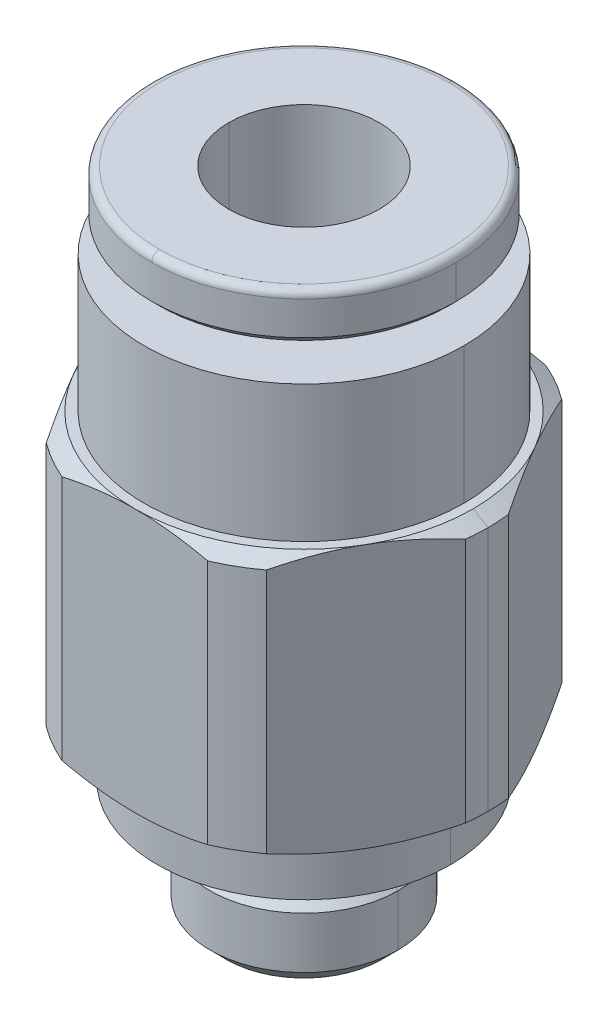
ISO-10303-21;
HEADER;
FILE_DESCRIPTION(('STEP AP214'),'2;1');
FILE_NAME('part.step','',(''),(''),'','','');
FILE_SCHEMA(('AUTOMOTIVE_DESIGN { 1 0 10303 214 1 1 1 1 }'));
ENDSEC;
DATA;
#1=APPLICATION_CONTEXT('core data for automotive mechanical design processes');
#2=APPLICATION_PROTOCOL_DEFINITION('international standard','automotive_design',2000,#1);
#3=PRODUCT_CONTEXT('',#1,'mechanical');
#4=PRODUCT('Part','Part','',(#3));
#5=PRODUCT_RELATED_PRODUCT_CATEGORY('part','',(#4));
#6=PRODUCT_DEFINITION_FORMATION('','',#4);
#7=PRODUCT_DEFINITION_CONTEXT('part definition',#1,'design');
#8=PRODUCT_DEFINITION('design','',#6,#7);
#9=PRODUCT_DEFINITION_SHAPE('','',#8);
#10=(LENGTH_UNIT() NAMED_UNIT(*) SI_UNIT(.MILLI.,.METRE.));
#11=(NAMED_UNIT(*) PLANE_ANGLE_UNIT() SI_UNIT($,.RADIAN.));
#12=(NAMED_UNIT(*) SI_UNIT($,.STERADIAN.) SOLID_ANGLE_UNIT());
#13=UNCERTAINTY_MEASURE_WITH_UNIT(LENGTH_MEASURE(1.E-05),#10,'distance_accuracy_value','');
#14=(GEOMETRIC_REPRESENTATION_CONTEXT(3) GLOBAL_UNCERTAINTY_ASSIGNED_CONTEXT((#13)) GLOBAL_UNIT_ASSIGNED_CONTEXT((#10,
#11,#12)) REPRESENTATION_CONTEXT('',''));
#15=CARTESIAN_POINT('',(0.,0.,0.));
#16=DIRECTION('',(0.,0.,1.));
#17=DIRECTION('',(1.,0.,0.));
#18=AXIS2_PLACEMENT_3D('',#15,#16,#17);
#19=CARTESIAN_POINT('',(0.,8.1,0.));
#20=DIRECTION('',(0.,1.,0.));
#21=DIRECTION('',(0.,0.,1.));
#22=AXIS2_PLACEMENT_3D('',#19,#20,#21);
#23=CYLINDRICAL_SURFACE('',#22,4.9);
#24=DIRECTION('',(0.,1.,0.));
#25=VECTOR('',#24,1.);
#26=CARTESIAN_POINT('',(-4.86665028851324,4.6,-0.570714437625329));
#27=LINE('',#26,#25);
#28=CARTESIAN_POINT('',(-4.86665028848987,4.83094010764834,-0.570714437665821));
#29=VERTEX_POINT('',#28);
#30=CARTESIAN_POINT('',(-4.86665028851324,11.3690598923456,-0.57071443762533));
#31=VERTEX_POINT('',#30);
#32=EDGE_CURVE('E478',#29,#31,#27,.T.);
#33=ORIENTED_EDGE('',*,*,#32,.F.);
#34=CARTESIAN_POINT('',(0.,4.83094010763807,0.));
#35=DIRECTION('',(0.,1.,0.));
#36=DIRECTION('',(1.,0.,0.));
#37=AXIS2_PLACEMENT_3D('',#34,#35,#36);
#38=CIRCLE('',#37,4.89999999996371);
#39=CARTESIAN_POINT('',(-4.89999999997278,4.83094010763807,0.));
#40=VERTEX_POINT('',#39);
#41=EDGE_CURVE('E487',#40,#29,#38,.F.);
#42=ORIENTED_EDGE('',*,*,#41,.F.);
#43=DIRECTION('',(0.,1.,0.));
#44=VECTOR('',#43,1.);
#45=CARTESIAN_POINT('',(-4.9,8.1,0.));
#46=LINE('',#45,#44);
#47=CARTESIAN_POINT('',(-4.89999999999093,11.3690598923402,0.));
#48=VERTEX_POINT('',#47);
#49=EDGE_CURVE('E241',#48,#40,#46,.F.);
#50=ORIENTED_EDGE('',*,*,#49,.F.);
#51=CARTESIAN_POINT('',(0.,11.3690598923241,0.));
#52=DIRECTION('',(0.,1.,0.));
#53=DIRECTION('',(0.,0.,1.));
#54=AXIS2_PLACEMENT_3D('',#51,#52,#53);
#55=CIRCLE('',#54,4.9);
#56=EDGE_CURVE('E536',#48,#31,#55,.F.);
#57=ORIENTED_EDGE('',*,*,#56,.T.);
#58=EDGE_LOOP('',(#33,#42,#50,#57));
#59=FACE_BOUND('',#58,.T.);
#60=ADVANCED_FACE('F16',(#59),#23,.T.);
#61=CARTESIAN_POINT('',(0.,8.1,0.));
#62=DIRECTION('',(0.,1.,0.));
#63=DIRECTION('',(0.,0.,1.));
#64=AXIS2_PLACEMENT_3D('',#61,#62,#63);
#65=CYLINDRICAL_SURFACE('',#64,4.9);
#66=DIRECTION('',(0.,1.,0.));
#67=VECTOR('',#66,1.);
#68=CARTESIAN_POINT('',(-4.86665028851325,4.6,0.570714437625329));
#69=LINE('',#68,#67);
#70=CARTESIAN_POINT('',(-4.86665028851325,11.3690598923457,0.570714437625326));
#71=VERTEX_POINT('',#70);
#72=CARTESIAN_POINT('',(-4.86665028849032,4.83094010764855,0.570714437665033));
#73=VERTEX_POINT('',#72);
#74=EDGE_CURVE('E475',#71,#73,#69,.F.);
#75=ORIENTED_EDGE('',*,*,#74,.F.);
#76=CARTESIAN_POINT('',(0.,11.3690598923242,0.));
#77=DIRECTION('',(0.,1.,0.));
#78=DIRECTION('',(0.,0.,1.));
#79=AXIS2_PLACEMENT_3D('',#76,#77,#78);
#80=CIRCLE('',#79,4.9);
#81=EDGE_CURVE('E528',#71,#48,#80,.F.);
#82=ORIENTED_EDGE('',*,*,#81,.T.);
#83=ORIENTED_EDGE('',*,*,#49,.T.);
#84=CARTESIAN_POINT('',(0.,4.83094010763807,0.));
#85=DIRECTION('',(0.,1.,0.));
#86=DIRECTION('',(1.,0.,0.));
#87=AXIS2_PLACEMENT_3D('',#84,#85,#86);
#88=CIRCLE('',#87,4.89999999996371);
#89=EDGE_CURVE('E486',#73,#40,#88,.F.);
#90=ORIENTED_EDGE('',*,*,#89,.F.);
#91=EDGE_LOOP('',(#75,#82,#83,#90));
#92=FACE_BOUND('',#91,.T.);
#93=ADVANCED_FACE('F728',(#92),#65,.T.);
#94=CARTESIAN_POINT('',(0.,8.1,0.));
#95=DIRECTION('',(0.,1.,0.));
#96=DIRECTION('',(0.,0.,1.));
#97=AXIS2_PLACEMENT_3D('',#94,#95,#96);
#98=CYLINDRICAL_SURFACE('',#97,4.9);
#99=CARTESIAN_POINT('',(0.,4.83094010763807,0.));
#100=DIRECTION('',(0.,1.,0.));
#101=DIRECTION('',(1.,0.,0.));
#102=AXIS2_PLACEMENT_3D('',#99,#100,#101);
#103=CIRCLE('',#102,4.89999999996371);
#104=CARTESIAN_POINT('',(-1.93907194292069,4.83094010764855,4.5));
#105=VERTEX_POINT('',#104);
#106=CARTESIAN_POINT('',(-2.92757834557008,4.83094010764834,3.92928556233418));
#107=VERTEX_POINT('',#106);
#108=EDGE_CURVE('E523',#105,#107,#103,.F.);
#109=ORIENTED_EDGE('',*,*,#108,.F.);
#110=DIRECTION('',(0.,1.,0.));
#111=VECTOR('',#110,1.);
#112=CARTESIAN_POINT('',(-1.93907194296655,4.6,4.5));
#113=LINE('',#112,#111);
#114=CARTESIAN_POINT('',(-1.93907194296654,11.36905989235,4.5));
#115=VERTEX_POINT('',#114);
#116=EDGE_CURVE('E468',#115,#105,#113,.F.);
#117=ORIENTED_EDGE('',*,*,#116,.F.);
#118=CARTESIAN_POINT('',(0.,11.3690598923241,0.));
#119=DIRECTION('',(0.,1.,0.));
#120=DIRECTION('',(0.,0.,1.));
#121=AXIS2_PLACEMENT_3D('',#118,#119,#120);
#122=CIRCLE('',#121,4.9);
#123=CARTESIAN_POINT('',(-2.92757834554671,11.36905989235,3.92928556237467));
#124=VERTEX_POINT('',#123);
#125=EDGE_CURVE('E525',#115,#124,#122,.F.);
#126=ORIENTED_EDGE('',*,*,#125,.T.);
#127=DIRECTION('',(0.,1.,0.));
#128=VECTOR('',#127,1.);
#129=CARTESIAN_POINT('',(-2.92757834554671,4.6,3.92928556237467));
#130=LINE('',#129,#128);
#131=EDGE_CURVE('E471',#107,#124,#130,.T.);
#132=ORIENTED_EDGE('',*,*,#131,.F.);
#133=EDGE_LOOP('',(#109,#117,#126,#132));
#134=FACE_BOUND('',#133,.T.);
#135=ADVANCED_FACE('F725',(#134),#98,.T.);
#136=CARTESIAN_POINT('',(0.,8.1,0.));
#137=DIRECTION('',(0.,1.,0.));
#138=DIRECTION('',(0.,0.,1.));
#139=AXIS2_PLACEMENT_3D('',#136,#137,#138);
#140=CYLINDRICAL_SURFACE('',#139,4.9);
#141=CARTESIAN_POINT('',(0.,4.83094010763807,0.));
#142=DIRECTION('',(0.,1.,0.));
#143=DIRECTION('',(1.,0.,0.));
#144=AXIS2_PLACEMENT_3D('',#141,#142,#143);
#145=CIRCLE('',#144,4.89999999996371);
#146=CARTESIAN_POINT('',(2.92757834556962,4.83094010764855,3.92928556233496));
#147=VERTEX_POINT('',#146);
#148=CARTESIAN_POINT('',(1.93907194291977,4.83094010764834,4.5));
#149=VERTEX_POINT('',#148);
#150=EDGE_CURVE('E483',#147,#149,#145,.F.);
#151=ORIENTED_EDGE('',*,*,#150,.F.);
#152=DIRECTION('',(0.,1.,0.));
#153=VECTOR('',#152,1.);
#154=CARTESIAN_POINT('',(2.9275783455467,4.6,3.92928556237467));
#155=LINE('',#154,#153);
#156=CARTESIAN_POINT('',(2.92757834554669,11.36905989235,3.92928556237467));
#157=VERTEX_POINT('',#156);
#158=EDGE_CURVE('E461',#157,#147,#155,.F.);
#159=ORIENTED_EDGE('',*,*,#158,.F.);
#160=CARTESIAN_POINT('',(0.,11.3690598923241,0.));
#161=DIRECTION('',(0.,1.,0.));
#162=DIRECTION('',(0.,0.,1.));
#163=AXIS2_PLACEMENT_3D('',#160,#161,#162);
#164=CIRCLE('',#163,4.9);
#165=CARTESIAN_POINT('',(1.93907194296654,11.36905989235,4.5));
#166=VERTEX_POINT('',#165);
#167=EDGE_CURVE('E516',#157,#166,#164,.F.);
#168=ORIENTED_EDGE('',*,*,#167,.T.);
#169=DIRECTION('',(0.,1.,0.));
#170=VECTOR('',#169,1.);
#171=CARTESIAN_POINT('',(1.93907194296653,4.6,4.5));
#172=LINE('',#171,#170);
#173=EDGE_CURVE('E464',#149,#166,#172,.T.);
#174=ORIENTED_EDGE('',*,*,#173,.F.);
#175=EDGE_LOOP('',(#151,#159,#168,#174));
#176=FACE_BOUND('',#175,.T.);
#177=ADVANCED_FACE('F721',(#176),#140,.T.);
#178=CARTESIAN_POINT('',(0.,8.1,0.));
#179=DIRECTION('',(0.,1.,0.));
#180=DIRECTION('',(0.,0.,1.));
#181=AXIS2_PLACEMENT_3D('',#178,#179,#180);
#182=CYLINDRICAL_SURFACE('',#181,4.9);
#183=DIRECTION('',(0.,1.,0.));
#184=VECTOR('',#183,1.);
#185=CARTESIAN_POINT('',(4.86665028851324,4.6,0.570714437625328));
#186=LINE('',#185,#184);
#187=CARTESIAN_POINT('',(4.86665028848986,4.83094010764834,0.57071443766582));
#188=VERTEX_POINT('',#187);
#189=CARTESIAN_POINT('',(4.86665028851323,11.3690598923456,0.570714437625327));
#190=VERTEX_POINT('',#189);
#191=EDGE_CURVE('E457',#188,#190,#186,.T.);
#192=ORIENTED_EDGE('',*,*,#191,.F.);
#193=CARTESIAN_POINT('',(0.,4.83094010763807,0.));
#194=DIRECTION('',(0.,1.,0.));
#195=DIRECTION('',(1.,0.,0.));
#196=AXIS2_PLACEMENT_3D('',#193,#194,#195);
#197=CIRCLE('',#196,4.89999999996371);
#198=CARTESIAN_POINT('',(4.89999999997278,4.83094010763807,0.));
#199=VERTEX_POINT('',#198);
#200=EDGE_CURVE('E493',#199,#188,#197,.F.);
#201=ORIENTED_EDGE('',*,*,#200,.F.);
#202=DIRECTION('',(0.,1.,0.));
#203=VECTOR('',#202,1.);
#204=CARTESIAN_POINT('',(4.90000000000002,8.1,0.));
#205=LINE('',#204,#203);
#206=CARTESIAN_POINT('',(4.89999999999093,11.3690598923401,0.));
#207=VERTEX_POINT('',#206);
#208=EDGE_CURVE('E508',#207,#199,#205,.F.);
#209=ORIENTED_EDGE('',*,*,#208,.F.);
#210=CARTESIAN_POINT('',(0.,11.3690598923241,0.));
#211=DIRECTION('',(0.,1.,0.));
#212=DIRECTION('',(0.,0.,1.));
#213=AXIS2_PLACEMENT_3D('',#210,#211,#212);
#214=CIRCLE('',#213,4.9);
#215=EDGE_CURVE('E514',#207,#190,#214,.F.);
#216=ORIENTED_EDGE('',*,*,#215,.T.);
#217=EDGE_LOOP('',(#192,#201,#209,#216));
#218=FACE_BOUND('',#217,.T.);
#219=ADVANCED_FACE('F717',(#218),#182,.T.);
#220=CARTESIAN_POINT('',(0.,8.1,0.));
#221=DIRECTION('',(0.,1.,0.));
#222=DIRECTION('',(0.,0.,1.));
#223=AXIS2_PLACEMENT_3D('',#220,#221,#222);
#224=CYLINDRICAL_SURFACE('',#223,4.9);
#225=CARTESIAN_POINT('',(0.,4.83094010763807,0.));
#226=DIRECTION('',(0.,1.,0.));
#227=DIRECTION('',(1.,0.,0.));
#228=AXIS2_PLACEMENT_3D('',#225,#226,#227);
#229=CIRCLE('',#228,4.89999999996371);
#230=CARTESIAN_POINT('',(-2.92757834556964,4.83094010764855,-3.92928556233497));
#231=VERTEX_POINT('',#230);
#232=CARTESIAN_POINT('',(-1.93907194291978,4.83094010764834,-4.5));
#233=VERTEX_POINT('',#232);
#234=EDGE_CURVE('E501',#231,#233,#229,.F.);
#235=ORIENTED_EDGE('',*,*,#234,.F.);
#236=DIRECTION('',(0.,1.,0.));
#237=VECTOR('',#236,1.);
#238=CARTESIAN_POINT('',(-2.9275783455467,4.6,-3.92928556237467));
#239=LINE('',#238,#237);
#240=CARTESIAN_POINT('',(-2.9275783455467,11.36905989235,-3.92928556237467));
#241=VERTEX_POINT('',#240);
#242=EDGE_CURVE('E232',#241,#231,#239,.F.);
#243=ORIENTED_EDGE('',*,*,#242,.F.);
#244=CARTESIAN_POINT('',(0.,11.3690598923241,0.));
#245=DIRECTION('',(0.,1.,0.));
#246=DIRECTION('',(0.,0.,1.));
#247=AXIS2_PLACEMENT_3D('',#244,#245,#246);
#248=CIRCLE('',#247,4.9);
#249=CARTESIAN_POINT('',(-1.93907194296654,11.36905989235,-4.5));
#250=VERTEX_POINT('',#249);
#251=EDGE_CURVE('E512',#241,#250,#248,.F.);
#252=ORIENTED_EDGE('',*,*,#251,.T.);
#253=DIRECTION('',(0.,1.,0.));
#254=VECTOR('',#253,1.);
#255=CARTESIAN_POINT('',(-1.93907194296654,4.6,-4.5));
#256=LINE('',#255,#254);
#257=EDGE_CURVE('E454',#233,#250,#256,.T.);
#258=ORIENTED_EDGE('',*,*,#257,.F.);
#259=EDGE_LOOP('',(#235,#243,#252,#258));
#260=FACE_BOUND('',#259,.T.);
#261=ADVANCED_FACE('F713',(#260),#224,.T.);
#262=CARTESIAN_POINT('',(0.,8.1,0.));
#263=DIRECTION('',(0.,1.,0.));
#264=DIRECTION('',(0.,0.,1.));
#265=AXIS2_PLACEMENT_3D('',#262,#263,#264);
#266=CYLINDRICAL_SURFACE('',#265,4.9);
#267=DIRECTION('',(0.,1.,0.));
#268=VECTOR('',#267,1.);
#269=CARTESIAN_POINT('',(4.86665028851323,4.6,-0.570714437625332));
#270=LINE('',#269,#268);
#271=CARTESIAN_POINT('',(4.86665028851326,11.3690598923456,-0.570714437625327));
#272=VERTEX_POINT('',#271);
#273=CARTESIAN_POINT('',(4.8666502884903,4.83094010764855,-0.570714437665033));
#274=VERTEX_POINT('',#273);
#275=EDGE_CURVE('E447',#272,#274,#270,.F.);
#276=ORIENTED_EDGE('',*,*,#275,.F.);
#277=CARTESIAN_POINT('',(0.,11.3690598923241,0.));
#278=DIRECTION('',(0.,1.,0.));
#279=DIRECTION('',(0.,0.,1.));
#280=AXIS2_PLACEMENT_3D('',#277,#278,#279);
#281=CIRCLE('',#280,4.9);
#282=EDGE_CURVE('E498',#272,#207,#281,.F.);
#283=ORIENTED_EDGE('',*,*,#282,.T.);
#284=ORIENTED_EDGE('',*,*,#208,.T.);
#285=CARTESIAN_POINT('',(0.,4.83094010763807,0.));
#286=DIRECTION('',(0.,1.,0.));
#287=DIRECTION('',(1.,0.,0.));
#288=AXIS2_PLACEMENT_3D('',#285,#286,#287);
#289=CIRCLE('',#288,4.89999999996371);
#290=EDGE_CURVE('E492',#274,#199,#289,.F.);
#291=ORIENTED_EDGE('',*,*,#290,.F.);
#292=EDGE_LOOP('',(#276,#283,#284,#291));
#293=FACE_BOUND('',#292,.T.);
#294=ADVANCED_FACE('F709',(#293),#266,.T.);
#295=CARTESIAN_POINT('',(0.,8.1,0.));
#296=DIRECTION('',(0.,1.,0.));
#297=DIRECTION('',(0.,0.,1.));
#298=AXIS2_PLACEMENT_3D('',#295,#296,#297);
#299=CYLINDRICAL_SURFACE('',#298,4.9);
#300=CARTESIAN_POINT('',(0.,4.83094010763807,0.));
#301=DIRECTION('',(0.,1.,0.));
#302=DIRECTION('',(1.,0.,0.));
#303=AXIS2_PLACEMENT_3D('',#300,#301,#302);
#304=CIRCLE('',#303,4.89999999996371);
#305=CARTESIAN_POINT('',(1.93907194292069,4.83094010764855,-4.5));
#306=VERTEX_POINT('',#305);
#307=CARTESIAN_POINT('',(2.92757834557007,4.83094010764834,-3.92928556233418));
#308=VERTEX_POINT('',#307);
#309=EDGE_CURVE('E499',#306,#308,#304,.F.);
#310=ORIENTED_EDGE('',*,*,#309,.F.);
#311=DIRECTION('',(0.,1.,0.));
#312=VECTOR('',#311,1.);
#313=CARTESIAN_POINT('',(1.93907194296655,4.6,-4.5));
#314=LINE('',#313,#312);
#315=CARTESIAN_POINT('',(1.93907194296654,11.3690598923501,-4.50000000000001));
#316=VERTEX_POINT('',#315);
#317=EDGE_CURVE('E451',#316,#306,#314,.F.);
#318=ORIENTED_EDGE('',*,*,#317,.F.);
#319=CARTESIAN_POINT('',(0.,11.3690598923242,0.));
#320=DIRECTION('',(0.,1.,0.));
#321=DIRECTION('',(0.,0.,1.));
#322=AXIS2_PLACEMENT_3D('',#319,#320,#321);
#323=CIRCLE('',#322,4.9);
#324=CARTESIAN_POINT('',(2.92757834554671,11.3690598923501,-3.92928556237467));
#325=VERTEX_POINT('',#324);
#326=EDGE_CURVE('E496',#316,#325,#323,.F.);
#327=ORIENTED_EDGE('',*,*,#326,.T.);
#328=DIRECTION('',(0.,1.,0.));
#329=VECTOR('',#328,1.);
#330=CARTESIAN_POINT('',(2.92757834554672,4.6,-3.92928556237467));
#331=LINE('',#330,#329);
#332=EDGE_CURVE('E442',#308,#325,#331,.T.);
#333=ORIENTED_EDGE('',*,*,#332,.F.);
#334=EDGE_LOOP('',(#310,#318,#327,#333));
#335=FACE_BOUND('',#334,.T.);
#336=ADVANCED_FACE('F705',(#335),#299,.T.);
#337=CARTESIAN_POINT('',(0.,4.83094010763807,0.));
#338=DIRECTION('',(0.,1.,0.));
#339=DIRECTION('',(0.,0.,1.));
#340=AXIS2_PLACEMENT_3D('',#337,#338,#339);
#341=CONICAL_SURFACE('',#340,4.89999999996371,1.04719755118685);
#342=CARTESIAN_POINT('',(3.89711431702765,4.59999999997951,2.24999999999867));
#343=CARTESIAN_POINT('',(3.93796270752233,4.599995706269,2.17924851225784));
#344=CARTESIAN_POINT('',(3.97880814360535,4.60128492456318,2.10850214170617));
#345=CARTESIAN_POINT('',(4.06045663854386,4.60641285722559,1.96708280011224));
#346=CARTESIAN_POINT('',(4.10125969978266,4.61025141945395,1.89640982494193));
#347=CARTESIAN_POINT('',(4.22328884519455,4.62550144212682,1.68504914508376));
#348=CARTESIAN_POINT('',(4.30440496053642,4.64064775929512,1.54455191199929));
#349=CARTESIAN_POINT('',(4.46601852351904,4.68021105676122,1.26462900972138));
#350=CARTESIAN_POINT('',(4.54651621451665,4.70462417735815,1.12520291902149));
#351=CARTESIAN_POINT('',(4.70704083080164,4.76177947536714,0.847166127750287));
#352=CARTESIAN_POINT('',(4.78706540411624,4.79454823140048,0.708559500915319));
#353=CARTESIAN_POINT('',(4.86665028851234,4.83094010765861,0.570714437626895));
#354=B_SPLINE_CURVE_WITH_KNOTS('',3,(#342,#343,#344,#345,#346,#347,#348,#349,#350,#351,#352,
#353),.UNSPECIFIED.,.F.,.F.,(4,2,2,2,2,4),(0.,0.245068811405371,0.490122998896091,
0.9786137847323,1.46690133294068,1.95676189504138),.UNSPECIFIED.);
#355=CARTESIAN_POINT('',(3.89711431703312,4.59999999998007,2.25000000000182));
#356=VERTEX_POINT('',#355);
#357=EDGE_CURVE('E460',#356,#188,#354,.T.);
#358=ORIENTED_EDGE('',*,*,#357,.F.);
#359=CARTESIAN_POINT('',(0.,4.59999999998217,0.));
#360=DIRECTION('',(0.,1.,0.));
#361=DIRECTION('',(0.,0.,1.));
#362=AXIS2_PLACEMENT_3D('',#359,#360,#361);
#363=CIRCLE('',#362,4.50000000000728);
#364=CARTESIAN_POINT('',(4.50000000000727,4.59999999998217,0.));
#365=VERTEX_POINT('',#364);
#366=EDGE_CURVE('E445',#356,#365,#363,.T.);
#367=ORIENTED_EDGE('',*,*,#366,.T.);
#368=DIRECTION('',(-0.86602540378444,-0.499999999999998,0.));
#369=VECTOR('',#368,1.);
#370=CARTESIAN_POINT('',(499000.,288099.78624941,-3.98754380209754E-11));
#371=LINE('',#370,#369);
#372=EDGE_CURVE('E490',#199,#365,#371,.T.);
#373=ORIENTED_EDGE('',*,*,#372,.F.);
#374=ORIENTED_EDGE('',*,*,#200,.T.);
#375=EDGE_LOOP('',(#358,#367,#373,#374));
#376=FACE_BOUND('',#375,.T.);
#377=ADVANCED_FACE('F701',(#376),#341,.T.);
#378=CARTESIAN_POINT('',(0.,4.83094010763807,0.));
#379=DIRECTION('',(0.,1.,0.));
#380=DIRECTION('',(0.,0.,1.));
#381=AXIS2_PLACEMENT_3D('',#378,#379,#380);
#382=CONICAL_SURFACE('',#381,4.89999999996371,1.04719755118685);
#383=CARTESIAN_POINT('',(4.86665028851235,4.83094010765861,-0.570714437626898));
#384=CARTESIAN_POINT('',(4.7870654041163,4.79454823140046,-0.708559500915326));
#385=CARTESIAN_POINT('',(4.70704083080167,4.76177947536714,-0.847166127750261));
#386=CARTESIAN_POINT('',(4.54651621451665,4.70462417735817,-1.12520291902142));
#387=CARTESIAN_POINT('',(4.46601852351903,4.68021105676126,-1.26462900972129));
#388=CARTESIAN_POINT('',(4.30440496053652,4.6406477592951,-1.54455191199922));
#389=CARTESIAN_POINT('',(4.22328884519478,4.62550144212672,-1.68504914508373));
#390=CARTESIAN_POINT('',(4.10125969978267,4.61025141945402,-1.89640982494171));
#391=CARTESIAN_POINT('',(4.06045663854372,4.60641285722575,-1.96708280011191));
#392=CARTESIAN_POINT('',(3.97880814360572,4.60128492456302,-2.10850214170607));
#393=CARTESIAN_POINT('',(3.93796270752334,4.59999570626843,-2.17924851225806));
#394=CARTESIAN_POINT('',(3.89711431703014,4.59999999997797,-2.2499999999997));
#395=B_SPLINE_CURVE_WITH_KNOTS('',3,(#383,#384,#385,#386,#387,#388,#389,#390,#391,#392,#393,
#394),.UNSPECIFIED.,.F.,.F.,(4,2,2,2,2,4),(0.,0.48986056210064,0.978148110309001,
1.46663889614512,1.71169308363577,1.95676189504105),.UNSPECIFIED.);
#396=CARTESIAN_POINT('',(3.89711431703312,4.59999999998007,-2.25000000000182));
#397=VERTEX_POINT('',#396);
#398=EDGE_CURVE('E449',#274,#397,#395,.T.);
#399=ORIENTED_EDGE('',*,*,#398,.F.);
#400=ORIENTED_EDGE('',*,*,#290,.T.);
#401=ORIENTED_EDGE('',*,*,#372,.T.);
#402=CARTESIAN_POINT('',(0.,4.59999999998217,0.));
#403=DIRECTION('',(0.,1.,0.));
#404=DIRECTION('',(0.,0.,1.));
#405=AXIS2_PLACEMENT_3D('',#402,#403,#404);
#406=CIRCLE('',#405,4.50000000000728);
#407=EDGE_CURVE('E1455',#365,#397,#406,.T.);
#408=ORIENTED_EDGE('',*,*,#407,.T.);
#409=EDGE_LOOP('',(#399,#400,#401,#408));
#410=FACE_BOUND('',#409,.T.);
#411=ADVANCED_FACE('F673',(#410),#382,.T.);
#412=CARTESIAN_POINT('',(0.,4.83094010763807,0.));
#413=DIRECTION('',(0.,1.,0.));
#414=DIRECTION('',(0.,0.,1.));
#415=AXIS2_PLACEMENT_3D('',#412,#413,#414);
#416=CONICAL_SURFACE('',#415,4.89999999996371,1.04719755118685);
#417=CARTESIAN_POINT('',(0.,4.59999999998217,0.));
#418=DIRECTION('',(0.,1.,0.));
#419=DIRECTION('',(0.,0.,1.));
#420=AXIS2_PLACEMENT_3D('',#417,#418,#419);
#421=CIRCLE('',#420,4.50000000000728);
#422=CARTESIAN_POINT('',(0.,4.59999999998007,-4.50000000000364));
#423=VERTEX_POINT('',#422);
#424=EDGE_CURVE('E1484',#397,#423,#421,.T.);
#425=ORIENTED_EDGE('',*,*,#424,.T.);
#426=CARTESIAN_POINT('',(1.93907194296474,4.83094010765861,-4.5));
#427=CARTESIAN_POINT('',(1.77990217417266,4.79454823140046,-4.5));
#428=CARTESIAN_POINT('',(1.61985302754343,4.76177947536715,-4.50000000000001));
#429=CARTESIAN_POINT('',(1.29880379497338,4.70462417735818,-4.50000000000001));
#430=CARTESIAN_POINT('',(1.13780841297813,4.68021105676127,-4.50000000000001));
#431=CARTESIAN_POINT('',(0.81458128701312,4.64064775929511,-4.50000000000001));
#432=CARTESIAN_POINT('',(0.65234905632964,4.62550144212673,-4.50000000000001));
#433=CARTESIAN_POINT('',(0.408290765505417,4.61025141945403,-4.50000000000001));
#434=CARTESIAN_POINT('',(0.326684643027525,4.60641285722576,-4.50000000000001));
#435=CARTESIAN_POINT('',(0.16338765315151,4.60128492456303,-4.50000000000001));
#436=CARTESIAN_POINT('',(0.0816967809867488,4.59999570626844,-4.5));
#437=CARTESIAN_POINT('',(3.48679418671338E-13,4.59999999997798,-4.5));
#438=B_SPLINE_CURVE_WITH_KNOTS('',3,(#426,#427,#428,#429,#430,#431,#432,#433,#434,#435,#436,
#437),.UNSPECIFIED.,.F.,.F.,(4,2,2,2,2,4),(0.,0.489860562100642,0.978148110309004,
1.46663889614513,1.71169308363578,1.95676189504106),.UNSPECIFIED.);
#439=EDGE_CURVE('E453',#306,#423,#438,.T.);
#440=ORIENTED_EDGE('',*,*,#439,.F.);
#441=ORIENTED_EDGE('',*,*,#309,.T.);
#442=CARTESIAN_POINT('',(3.89711431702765,4.59999999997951,-2.24999999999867));
#443=CARTESIAN_POINT('',(3.85626592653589,4.599995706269,-2.32075148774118));
#444=CARTESIAN_POINT('',(3.81542049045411,4.60128492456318,-2.39149785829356));
#445=CARTESIAN_POINT('',(3.73377199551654,4.60641285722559,-2.53291719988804));
#446=CARTESIAN_POINT('',(3.69296893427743,4.61025141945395,-2.60359017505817));
#447=CARTESIAN_POINT('',(3.57093978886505,4.62550144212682,-2.81495085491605));
#448=CARTESIAN_POINT('',(3.48982367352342,4.64064775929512,-2.95544808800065));
#449=CARTESIAN_POINT('',(3.32821011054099,4.68021105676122,-3.23537099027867));
#450=CARTESIAN_POINT('',(3.24771241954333,4.70462417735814,-3.37479708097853));
#451=CARTESIAN_POINT('',(3.08718780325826,4.76177947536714,-3.65283387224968));
#452=CARTESIAN_POINT('',(3.00716322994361,4.79454823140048,-3.79144049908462));
#453=CARTESIAN_POINT('',(2.92757834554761,4.83094010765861,-3.9292855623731));
#454=B_SPLINE_CURVE_WITH_KNOTS('',3,(#442,#443,#444,#445,#446,#447,#448,#449,#450,#451,#452,
#453),.UNSPECIFIED.,.F.,.F.,(4,2,2,2,2,4),(0.,0.245068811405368,0.490122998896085,
0.978613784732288,1.46690133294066,1.95676189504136),.UNSPECIFIED.);
#455=EDGE_CURVE('E446',#397,#308,#454,.T.);
#456=ORIENTED_EDGE('',*,*,#455,.F.);
#457=EDGE_LOOP('',(#425,#440,#441,#456));
#458=FACE_BOUND('',#457,.T.);
#459=ADVANCED_FACE('F669',(#458),#416,.T.);
#460=CARTESIAN_POINT('',(0.,4.83094010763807,0.));
#461=DIRECTION('',(0.,1.,0.));
#462=DIRECTION('',(0.,0.,1.));
#463=AXIS2_PLACEMENT_3D('',#460,#461,#462);
#464=CONICAL_SURFACE('',#463,4.89999999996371,1.04719755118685);
#465=CARTESIAN_POINT('',(0.,4.59999999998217,0.));
#466=DIRECTION('',(0.,1.,0.));
#467=DIRECTION('',(0.,0.,1.));
#468=AXIS2_PLACEMENT_3D('',#465,#466,#467);
#469=CIRCLE('',#468,4.50000000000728);
#470=CARTESIAN_POINT('',(-3.89711431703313,4.59999999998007,-2.25000000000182));
#471=VERTEX_POINT('',#470);
#472=EDGE_CURVE('E1486',#423,#471,#469,.T.);
#473=ORIENTED_EDGE('',*,*,#472,.T.);
#474=CARTESIAN_POINT('',(-2.92757834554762,4.83094010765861,-3.92928556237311));
#475=CARTESIAN_POINT('',(-3.00716322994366,4.79454823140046,-3.79144049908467));
#476=CARTESIAN_POINT('',(-3.08718780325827,4.76177947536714,-3.65283387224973));
#477=CARTESIAN_POINT('',(-3.24771241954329,4.70462417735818,-3.37479708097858));
#478=CARTESIAN_POINT('',(-3.32821011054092,4.68021105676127,-3.23537099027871));
#479=CARTESIAN_POINT('',(-3.48982367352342,4.64064775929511,-2.95544808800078));
#480=CARTESIAN_POINT('',(-3.57093978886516,4.62550144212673,-2.81495085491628));
#481=CARTESIAN_POINT('',(-3.69296893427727,4.61025141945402,-2.60359017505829));
#482=CARTESIAN_POINT('',(-3.73377199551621,4.60641285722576,-2.53291719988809));
#483=CARTESIAN_POINT('',(-3.81542049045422,4.60128492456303,-2.39149785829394));
#484=CARTESIAN_POINT('',(-3.8562659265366,4.59999570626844,-2.32075148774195));
#485=CARTESIAN_POINT('',(-3.8971143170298,4.59999999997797,-2.25000000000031));
#486=B_SPLINE_CURVE_WITH_KNOTS('',3,(#474,#475,#476,#477,#478,#479,#480,#481,#482,#483,#484,
#485),.UNSPECIFIED.,.F.,.F.,(4,2,2,2,2,4),(0.,0.489860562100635,0.97814811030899,
1.46663889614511,1.71169308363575,1.95676189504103),.UNSPECIFIED.);
#487=EDGE_CURVE('E19',#231,#471,#486,.T.);
#488=ORIENTED_EDGE('',*,*,#487,.F.);
#489=ORIENTED_EDGE('',*,*,#234,.T.);
#490=CARTESIAN_POINT('',(0.,4.59999999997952,-4.49999999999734));
#491=CARTESIAN_POINT('',(-0.0816967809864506,4.59999570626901,-4.49999999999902));
#492=CARTESIAN_POINT('',(-0.163387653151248,4.60128492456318,-4.49999999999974));
#493=CARTESIAN_POINT('',(-0.326684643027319,4.6064128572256,-4.50000000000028));
#494=CARTESIAN_POINT('',(-0.408290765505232,4.61025141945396,-4.5000000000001));
#495=CARTESIAN_POINT('',(-0.652349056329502,4.62550144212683,-4.49999999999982));
#496=CARTESIAN_POINT('',(-0.814581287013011,4.64064775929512,-4.49999999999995));
#497=CARTESIAN_POINT('',(-1.13780841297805,4.68021105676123,-4.50000000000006));
#498=CARTESIAN_POINT('',(-1.29880379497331,4.70462417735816,-4.50000000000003));
#499=CARTESIAN_POINT('',(-1.61985302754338,4.76177947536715,-4.49999999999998));
#500=CARTESIAN_POINT('',(-1.77990217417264,4.79454823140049,-4.49999999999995));
#501=CARTESIAN_POINT('',(-1.93907194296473,4.83094010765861,-4.5));
#502=B_SPLINE_CURVE_WITH_KNOTS('',3,(#490,#491,#492,#493,#494,#495,#496,#497,#498,#499,#500,
#501),.UNSPECIFIED.,.F.,.F.,(4,2,2,2,2,4),(0.,0.245068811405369,0.490122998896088,
0.978613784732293,1.46690133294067,1.95676189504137),.UNSPECIFIED.);
#503=EDGE_CURVE('E450',#423,#233,#502,.T.);
#504=ORIENTED_EDGE('',*,*,#503,.F.);
#505=EDGE_LOOP('',(#473,#488,#489,#504));
#506=FACE_BOUND('',#505,.T.);
#507=ADVANCED_FACE('F672',(#506),#464,.T.);
#508=CARTESIAN_POINT('',(0.,4.83094010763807,0.));
#509=DIRECTION('',(0.,1.,0.));
#510=DIRECTION('',(0.,0.,1.));
#511=AXIS2_PLACEMENT_3D('',#508,#509,#510);
#512=CONICAL_SURFACE('',#511,4.89999999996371,1.04719755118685);
#513=CARTESIAN_POINT('',(-3.89711431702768,4.59999999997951,-2.24999999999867));
#514=CARTESIAN_POINT('',(-3.93796270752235,4.599995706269,-2.17924851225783));
#515=CARTESIAN_POINT('',(-3.97880814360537,4.60128492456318,-2.10850214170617));
#516=CARTESIAN_POINT('',(-4.06045663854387,4.6064128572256,-1.96708280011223));
#517=CARTESIAN_POINT('',(-4.10125969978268,4.61025141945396,-1.89640982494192));
#518=CARTESIAN_POINT('',(-4.22328884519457,4.62550144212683,-1.68504914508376));
#519=CARTESIAN_POINT('',(-4.30440496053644,4.64064775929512,-1.54455191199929));
#520=CARTESIAN_POINT('',(-4.46601852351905,4.68021105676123,-1.26462900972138));
#521=CARTESIAN_POINT('',(-4.54651621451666,4.70462417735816,-1.12520291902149));
#522=CARTESIAN_POINT('',(-4.70704083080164,4.76177947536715,-0.847166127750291));
#523=CARTESIAN_POINT('',(-4.78706540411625,4.79454823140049,-0.708559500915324));
#524=CARTESIAN_POINT('',(-4.86665028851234,4.83094010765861,-0.570714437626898));
#525=B_SPLINE_CURVE_WITH_KNOTS('',3,(#513,#514,#515,#516,#517,#518,#519,#520,#521,#522,#523,
#524),.UNSPECIFIED.,.F.,.F.,(4,2,2,2,2,4),(0.,0.245068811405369,0.490122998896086,
0.97861378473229,1.46690133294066,1.95676189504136),.UNSPECIFIED.);
#526=EDGE_CURVE('E481',#471,#29,#525,.T.);
#527=ORIENTED_EDGE('',*,*,#526,.F.);
#528=CARTESIAN_POINT('',(0.,4.59999999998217,0.));
#529=DIRECTION('',(0.,1.,0.));
#530=DIRECTION('',(0.,0.,1.));
#531=AXIS2_PLACEMENT_3D('',#528,#529,#530);
#532=CIRCLE('',#531,4.50000000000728);
#533=CARTESIAN_POINT('',(-4.50000000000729,4.59999999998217,0.));
#534=VERTEX_POINT('',#533);
#535=EDGE_CURVE('E1491',#471,#534,#532,.T.);
#536=ORIENTED_EDGE('',*,*,#535,.T.);
#537=DIRECTION('',(0.86602540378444,-0.499999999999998,0.));
#538=VECTOR('',#537,1.);
#539=CARTESIAN_POINT('',(-499000.,288099.78624941,-5.40862927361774E-11));
#540=LINE('',#539,#538);
#541=EDGE_CURVE('E484',#40,#534,#540,.T.);
#542=ORIENTED_EDGE('',*,*,#541,.F.);
#543=ORIENTED_EDGE('',*,*,#41,.T.);
#544=EDGE_LOOP('',(#527,#536,#542,#543));
#545=FACE_BOUND('',#544,.T.);
#546=ADVANCED_FACE('F1391',(#545),#512,.T.);
#547=CARTESIAN_POINT('',(0.,4.83094010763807,0.));
#548=DIRECTION('',(0.,1.,0.));
#549=DIRECTION('',(0.,0.,1.));
#550=AXIS2_PLACEMENT_3D('',#547,#548,#549);
#551=CONICAL_SURFACE('',#550,4.89999999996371,1.04719755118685);
#552=CARTESIAN_POINT('',(-4.86665028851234,4.83094010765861,0.570714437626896));
#553=CARTESIAN_POINT('',(-4.7870654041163,4.79454823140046,0.70855950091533));
#554=CARTESIAN_POINT('',(-4.70704083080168,4.76177947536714,0.847166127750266));
#555=CARTESIAN_POINT('',(-4.54651621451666,4.70462417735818,1.12520291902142));
#556=CARTESIAN_POINT('',(-4.46601852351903,4.68021105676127,1.26462900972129));
#557=CARTESIAN_POINT('',(-4.30440496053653,4.6406477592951,1.54455191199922));
#558=CARTESIAN_POINT('',(-4.22328884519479,4.62550144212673,1.68504914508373));
#559=CARTESIAN_POINT('',(-4.10125969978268,4.61025141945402,1.89640982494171));
#560=CARTESIAN_POINT('',(-4.06045663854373,4.60641285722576,1.96708280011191));
#561=CARTESIAN_POINT('',(-3.97880814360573,4.60128492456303,2.10850214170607));
#562=CARTESIAN_POINT('',(-3.93796270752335,4.59999570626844,2.17924851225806));
#563=CARTESIAN_POINT('',(-3.89711431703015,4.59999999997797,2.2499999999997));
#564=B_SPLINE_CURVE_WITH_KNOTS('',3,(#552,#553,#554,#555,#556,#557,#558,#559,#560,#561,#562,
#563),.UNSPECIFIED.,.F.,.F.,(4,2,2,2,2,4),(0.,0.489860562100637,0.978148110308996,
1.46663889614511,1.71169308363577,1.95676189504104),.UNSPECIFIED.);
#565=CARTESIAN_POINT('',(-3.89711431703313,4.59999999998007,2.25000000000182));
#566=VERTEX_POINT('',#565);
#567=EDGE_CURVE('E477',#73,#566,#564,.T.);
#568=ORIENTED_EDGE('',*,*,#567,.F.);
#569=ORIENTED_EDGE('',*,*,#89,.T.);
#570=ORIENTED_EDGE('',*,*,#541,.T.);
#571=CARTESIAN_POINT('',(0.,4.59999999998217,0.));
#572=DIRECTION('',(0.,1.,0.));
#573=DIRECTION('',(0.,0.,1.));
#574=AXIS2_PLACEMENT_3D('',#571,#572,#573);
#575=CIRCLE('',#574,4.50000000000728);
#576=EDGE_CURVE('E1494',#534,#566,#575,.T.);
#577=ORIENTED_EDGE('',*,*,#576,.T.);
#578=EDGE_LOOP('',(#568,#569,#570,#577));
#579=FACE_BOUND('',#578,.T.);
#580=ADVANCED_FACE('F1383',(#579),#551,.T.);
#581=CARTESIAN_POINT('',(0.,4.83094010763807,0.));
#582=DIRECTION('',(0.,1.,0.));
#583=DIRECTION('',(0.,0.,1.));
#584=AXIS2_PLACEMENT_3D('',#581,#582,#583);
#585=CONICAL_SURFACE('',#584,4.89999999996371,1.04719755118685);
#586=CARTESIAN_POINT('',(0.,4.59999999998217,0.));
#587=DIRECTION('',(0.,1.,0.));
#588=DIRECTION('',(0.,0.,1.));
#589=AXIS2_PLACEMENT_3D('',#586,#587,#588);
#590=CIRCLE('',#589,4.50000000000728);
#591=CARTESIAN_POINT('',(0.,4.59999999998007,4.50000000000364));
#592=VERTEX_POINT('',#591);
#593=EDGE_CURVE('E1482',#566,#592,#590,.T.);
#594=ORIENTED_EDGE('',*,*,#593,.T.);
#595=CARTESIAN_POINT('',(-1.93907194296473,4.83094010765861,4.5));
#596=CARTESIAN_POINT('',(-1.77990217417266,4.79454823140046,4.5));
#597=CARTESIAN_POINT('',(-1.61985302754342,4.76177947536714,4.5));
#598=CARTESIAN_POINT('',(-1.29880379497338,4.70462417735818,4.5));
#599=CARTESIAN_POINT('',(-1.13780841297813,4.68021105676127,4.5));
#600=CARTESIAN_POINT('',(-0.81458128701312,4.6406477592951,4.5));
#601=CARTESIAN_POINT('',(-0.652349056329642,4.62550144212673,4.5));
#602=CARTESIAN_POINT('',(-0.40829076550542,4.61025141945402,4.5));
#603=CARTESIAN_POINT('',(-0.326684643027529,4.60641285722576,4.5));
#604=CARTESIAN_POINT('',(-0.163387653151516,4.60128492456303,4.5));
#605=CARTESIAN_POINT('',(-0.0816967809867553,4.59999570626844,4.5));
#606=CARTESIAN_POINT('',(-3.55618312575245E-13,4.59999999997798,4.5));
#607=B_SPLINE_CURVE_WITH_KNOTS('',3,(#595,#596,#597,#598,#599,#600,#601,#602,#603,#604,#605,
#606),.UNSPECIFIED.,.F.,.F.,(4,2,2,2,2,4),(0.,0.489860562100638,0.978148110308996,
1.46663889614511,1.71169308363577,1.95676189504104),.UNSPECIFIED.);
#608=EDGE_CURVE('E470',#105,#592,#607,.T.);
#609=ORIENTED_EDGE('',*,*,#608,.F.);
#610=ORIENTED_EDGE('',*,*,#108,.T.);
#611=CARTESIAN_POINT('',(-3.89711431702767,4.59999999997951,2.24999999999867));
#612=CARTESIAN_POINT('',(-3.8562659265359,4.599995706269,2.32075148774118));
#613=CARTESIAN_POINT('',(-3.81542049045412,4.60128492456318,2.39149785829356));
#614=CARTESIAN_POINT('',(-3.73377199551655,4.60641285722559,2.53291719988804));
#615=CARTESIAN_POINT('',(-3.69296893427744,4.61025141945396,2.60359017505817));
#616=CARTESIAN_POINT('',(-3.57093978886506,4.62550144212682,2.81495085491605));
#617=CARTESIAN_POINT('',(-3.48982367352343,4.64064775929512,2.95544808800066));
#618=CARTESIAN_POINT('',(-3.328210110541,4.68021105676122,3.23537099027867));
#619=CARTESIAN_POINT('',(-3.24771241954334,4.70462417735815,3.37479708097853));
#620=CARTESIAN_POINT('',(-3.08718780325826,4.76177947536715,3.65283387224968));
#621=CARTESIAN_POINT('',(-3.00716322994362,4.79454823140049,3.79144049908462));
#622=CARTESIAN_POINT('',(-2.92757834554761,4.83094010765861,3.9292855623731));
#623=B_SPLINE_CURVE_WITH_KNOTS('',3,(#611,#612,#613,#614,#615,#616,#617,#618,#619,#620,#621,
#622),.UNSPECIFIED.,.F.,.F.,(4,2,2,2,2,4),(0.,0.245068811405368,0.490122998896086,
0.978613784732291,1.46690133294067,1.95676189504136),.UNSPECIFIED.);
#624=EDGE_CURVE('E474',#566,#107,#623,.T.);
#625=ORIENTED_EDGE('',*,*,#624,.F.);
#626=EDGE_LOOP('',(#594,#609,#610,#625));
#627=FACE_BOUND('',#626,.T.);
#628=ADVANCED_FACE('F1376',(#627),#585,.T.);
#629=CARTESIAN_POINT('',(0.,4.83094010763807,0.));
#630=DIRECTION('',(0.,1.,0.));
#631=DIRECTION('',(0.,0.,1.));
#632=AXIS2_PLACEMENT_3D('',#629,#630,#631);
#633=CONICAL_SURFACE('',#632,4.89999999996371,1.04719755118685);
#634=CARTESIAN_POINT('',(0.,4.59999999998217,0.));
#635=DIRECTION('',(0.,1.,0.));
#636=DIRECTION('',(0.,0.,1.));
#637=AXIS2_PLACEMENT_3D('',#634,#635,#636);
#638=CIRCLE('',#637,4.50000000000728);
#639=EDGE_CURVE('E1476',#592,#356,#638,.T.);
#640=ORIENTED_EDGE('',*,*,#639,.T.);
#641=CARTESIAN_POINT('',(2.9275783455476,4.83094010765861,3.92928556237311));
#642=CARTESIAN_POINT('',(3.00716322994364,4.79454823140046,3.79144049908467));
#643=CARTESIAN_POINT('',(3.08718780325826,4.76177947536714,3.65283387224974));
#644=CARTESIAN_POINT('',(3.24771241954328,4.70462417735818,3.37479708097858));
#645=CARTESIAN_POINT('',(3.32821011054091,4.68021105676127,3.23537099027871));
#646=CARTESIAN_POINT('',(3.48982367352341,4.6406477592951,2.95544808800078));
#647=CARTESIAN_POINT('',(3.57093978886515,4.62550144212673,2.81495085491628));
#648=CARTESIAN_POINT('',(3.69296893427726,4.61025141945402,2.60359017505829));
#649=CARTESIAN_POINT('',(3.7337719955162,4.60641285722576,2.53291719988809));
#650=CARTESIAN_POINT('',(3.81542049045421,4.60128492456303,2.39149785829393));
#651=CARTESIAN_POINT('',(3.85626592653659,4.59999570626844,2.32075148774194));
#652=CARTESIAN_POINT('',(3.89711431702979,4.59999999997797,2.25000000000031));
#653=B_SPLINE_CURVE_WITH_KNOTS('',3,(#641,#642,#643,#644,#645,#646,#647,#648,#649,#650,#651,
#652),.UNSPECIFIED.,.F.,.F.,(4,2,2,2,2,4),(0.,0.489860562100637,0.978148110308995,
1.46663889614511,1.71169308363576,1.95676189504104),.UNSPECIFIED.);
#654=EDGE_CURVE('E463',#147,#356,#653,.T.);
#655=ORIENTED_EDGE('',*,*,#654,.F.);
#656=ORIENTED_EDGE('',*,*,#150,.T.);
#657=CARTESIAN_POINT('',(0.,4.59999999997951,4.49999999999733));
#658=CARTESIAN_POINT('',(0.0816967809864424,4.599995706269,4.49999999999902));
#659=CARTESIAN_POINT('',(0.16338765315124,4.60128492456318,4.49999999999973));
#660=CARTESIAN_POINT('',(0.326684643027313,4.6064128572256,4.50000000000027));
#661=CARTESIAN_POINT('',(0.408290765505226,4.61025141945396,4.5000000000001));
#662=CARTESIAN_POINT('',(0.652349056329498,4.62550144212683,4.49999999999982));
#663=CARTESIAN_POINT('',(0.814581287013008,4.64064775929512,4.49999999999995));
#664=CARTESIAN_POINT('',(1.13780841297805,4.68021105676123,4.50000000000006));
#665=CARTESIAN_POINT('',(1.29880379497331,4.70462417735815,4.50000000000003));
#666=CARTESIAN_POINT('',(1.61985302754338,4.76177947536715,4.49999999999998));
#667=CARTESIAN_POINT('',(1.77990217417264,4.79454823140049,4.49999999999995));
#668=CARTESIAN_POINT('',(1.93907194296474,4.83094010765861,4.5));
#669=B_SPLINE_CURVE_WITH_KNOTS('',3,(#657,#658,#659,#660,#661,#662,#663,#664,#665,#666,#667,
#668),.UNSPECIFIED.,.F.,.F.,(4,2,2,2,2,4),(0.,0.245068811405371,0.490122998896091,
0.9786137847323,1.46690133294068,1.95676189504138),.UNSPECIFIED.);
#670=EDGE_CURVE('E467',#592,#149,#669,.T.);
#671=ORIENTED_EDGE('',*,*,#670,.F.);
#672=EDGE_LOOP('',(#640,#655,#656,#671));
#673=FACE_BOUND('',#672,.T.);
#674=ADVANCED_FACE('F1370',(#673),#633,.T.);
#675=CARTESIAN_POINT('',(-3.89711431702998,4.6,-2.25));
#676=DIRECTION('',(-0.866025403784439,0.,-0.500000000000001));
#677=DIRECTION('',(-0.500000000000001,0.,0.866025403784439));
#678=AXIS2_PLACEMENT_3D('',#675,#676,#677);
#679=PLANE('',#678);
#680=CARTESIAN_POINT('',(-3.89711431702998,11.6000000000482,-2.25));
#681=CARTESIAN_POINT('',(-3.93796270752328,11.6000042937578,-2.17924851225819));
#682=CARTESIAN_POINT('',(-3.97880814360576,11.5987150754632,-2.10850214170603));
#683=CARTESIAN_POINT('',(-4.06045663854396,11.5935871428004,-1.96708280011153));
#684=CARTESIAN_POINT('',(-4.10125969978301,11.5897485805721,-1.89640982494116));
#685=CARTESIAN_POINT('',(-4.22328884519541,11.5744985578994,-1.68504914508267));
#686=CARTESIAN_POINT('',(-4.30440496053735,11.5593522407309,-1.54455191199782));
#687=CARTESIAN_POINT('',(-4.46601852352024,11.5197889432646,-1.26462900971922));
#688=CARTESIAN_POINT('',(-4.54651621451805,11.4953758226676,-1.12520291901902));
#689=CARTESIAN_POINT('',(-4.70704083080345,11.4382205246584,-0.847166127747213));
#690=CARTESIAN_POINT('',(-4.78706540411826,11.4054517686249,-0.708559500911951));
#691=CARTESIAN_POINT('',(-4.86665028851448,11.3690598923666,-0.570714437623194));
#692=B_SPLINE_CURVE_WITH_KNOTS('',3,(#680,#681,#682,#683,#684,#685,#686,#687,#688,#689,#690,
#691),.UNSPECIFIED.,.F.,.F.,(4,2,2,2,2,4),(0.,0.245068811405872,0.490122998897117,
0.978613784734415,1.46690133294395,1.95676189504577),.UNSPECIFIED.);
#693=CARTESIAN_POINT('',(-3.89711431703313,11.6000000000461,-2.25000000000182));
#694=VERTEX_POINT('',#693);
#695=EDGE_CURVE('E439',#694,#31,#692,.T.);
#696=ORIENTED_EDGE('',*,*,#695,.F.);
#697=CARTESIAN_POINT('',(-2.92757834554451,11.369059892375,-3.92928556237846));
#698=CARTESIAN_POINT('',(-3.00716322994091,11.405451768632,-3.79144049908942));
#699=CARTESIAN_POINT('',(-3.08718780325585,11.4382205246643,-3.65283387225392));
#700=CARTESIAN_POINT('',(-3.24771241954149,11.4953758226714,-3.3747970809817));
#701=CARTESIAN_POINT('',(-3.32821011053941,11.5197889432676,-3.23537099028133));
#702=CARTESIAN_POINT('',(-3.48982367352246,11.5593522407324,-2.95544808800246));
#703=CARTESIAN_POINT('',(-3.57093978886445,11.5744985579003,-2.81495085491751));
#704=CARTESIAN_POINT('',(-3.69296893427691,11.5897485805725,-2.60359017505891));
#705=CARTESIAN_POINT('',(-3.73377199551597,11.5935871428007,-2.53291719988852));
#706=CARTESIAN_POINT('',(-3.81542049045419,11.5987150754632,-2.39149785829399));
#707=CARTESIAN_POINT('',(-3.85626592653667,11.6000042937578,-2.32075148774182));
#708=CARTESIAN_POINT('',(-3.89711431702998,11.6000000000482,-2.25));
#709=B_SPLINE_CURVE_WITH_KNOTS('',3,(#697,#698,#699,#700,#701,#702,#703,#704,#705,#706,#707,
#708),.UNSPECIFIED.,.F.,.F.,(4,2,2,2,2,4),(0.,0.489860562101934,0.978148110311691,
1.4666388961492,1.71169308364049,1.9567618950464),.UNSPECIFIED.);
#710=EDGE_CURVE('E1481',#241,#694,#709,.T.);
#711=ORIENTED_EDGE('',*,*,#710,.F.);
#712=ORIENTED_EDGE('',*,*,#242,.T.);
#713=ORIENTED_EDGE('',*,*,#487,.T.);
#714=ORIENTED_EDGE('',*,*,#526,.T.);
#715=ORIENTED_EDGE('',*,*,#32,.T.);
#716=EDGE_LOOP('',(#696,#711,#712,#713,#714,#715));
#717=FACE_BOUND('',#716,.T.);
#718=ADVANCED_FACE('F1362',(#717),#679,.T.);
#719=CARTESIAN_POINT('',(-3.89711431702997,4.6,2.25));
#720=DIRECTION('',(-0.866025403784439,0.,0.5));
#721=DIRECTION('',(0.5,0.,0.866025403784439));
#722=AXIS2_PLACEMENT_3D('',#719,#720,#721);
#723=PLANE('',#722);
#724=CARTESIAN_POINT('',(-3.89711431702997,11.6000000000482,2.25));
#725=CARTESIAN_POINT('',(-3.85626592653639,11.6000042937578,2.3207514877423));
#726=CARTESIAN_POINT('',(-3.81542049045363,11.5987150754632,2.39149785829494));
#727=CARTESIAN_POINT('',(-3.73377199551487,11.5935871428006,2.53291719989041));
#728=CARTESIAN_POINT('',(-3.69296893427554,11.5897485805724,2.60359017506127));
#729=CARTESIAN_POINT('',(-3.57093978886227,11.5744985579,2.81495085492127));
#730=CARTESIAN_POINT('',(-3.48982367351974,11.5593522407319,2.95544808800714));
#731=CARTESIAN_POINT('',(-3.32821011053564,11.5197889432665,3.23537099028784));
#732=CARTESIAN_POINT('',(-3.2477124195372,11.4953758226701,3.37479708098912));
#733=CARTESIAN_POINT('',(-3.08718780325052,11.4382205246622,3.65283387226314));
#734=CARTESIAN_POINT('',(-3.00716322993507,11.4054517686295,3.79144049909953));
#735=CARTESIAN_POINT('',(-2.92757834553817,11.3690598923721,3.92928556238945));
#736=B_SPLINE_CURVE_WITH_KNOTS('',3,(#724,#725,#726,#727,#728,#729,#730,#731,#732,#733,#734,
#735),.UNSPECIFIED.,.F.,.F.,(4,2,2,2,2,4),(0.,0.245068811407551,0.490122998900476,
0.978613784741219,1.46690133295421,1.9567618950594),.UNSPECIFIED.);
#737=CARTESIAN_POINT('',(-3.89711431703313,11.6000000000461,2.25000000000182));
#738=VERTEX_POINT('',#737);
#739=EDGE_CURVE('E1553',#738,#124,#736,.T.);
#740=ORIENTED_EDGE('',*,*,#739,.F.);
#741=CARTESIAN_POINT('',(-4.86665028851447,11.3690598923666,0.570714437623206));
#742=CARTESIAN_POINT('',(-4.78706540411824,11.4054517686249,0.708559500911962));
#743=CARTESIAN_POINT('',(-4.70704083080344,11.4382205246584,0.847166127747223));
#744=CARTESIAN_POINT('',(-4.54651621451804,11.4953758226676,1.12520291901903));
#745=CARTESIAN_POINT('',(-4.46601852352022,11.5197889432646,1.26462900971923));
#746=CARTESIAN_POINT('',(-4.30440496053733,11.5593522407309,1.54455191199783));
#747=CARTESIAN_POINT('',(-4.2232888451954,11.5744985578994,1.68504914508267));
#748=CARTESIAN_POINT('',(-4.101259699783,11.5897485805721,1.89640982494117));
#749=CARTESIAN_POINT('',(-4.06045663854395,11.5935871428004,1.96708280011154));
#750=CARTESIAN_POINT('',(-3.97880814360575,11.5987150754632,2.10850214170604));
#751=CARTESIAN_POINT('',(-3.93796270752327,11.6000042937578,2.1792485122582));
#752=CARTESIAN_POINT('',(-3.89711431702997,11.6000000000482,2.25));
#753=B_SPLINE_CURVE_WITH_KNOTS('',3,(#741,#742,#743,#744,#745,#746,#747,#748,#749,#750,#751,
#752),.UNSPECIFIED.,.F.,.F.,(4,2,2,2,2,4),(0.,0.489860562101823,0.978148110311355,
1.46663889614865,1.7116930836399,1.95676189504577),.UNSPECIFIED.);
#754=EDGE_CURVE('E438',#71,#738,#753,.T.);
#755=ORIENTED_EDGE('',*,*,#754,.F.);
#756=ORIENTED_EDGE('',*,*,#74,.T.);
#757=ORIENTED_EDGE('',*,*,#567,.T.);
#758=ORIENTED_EDGE('',*,*,#624,.T.);
#759=ORIENTED_EDGE('',*,*,#131,.T.);
#760=EDGE_LOOP('',(#740,#755,#756,#757,#758,#759));
#761=FACE_BOUND('',#760,.T.);
#762=ADVANCED_FACE('F1355',(#761),#723,.T.);
#763=CARTESIAN_POINT('',(0.,4.6,4.5));
#764=DIRECTION('',(0.,0.,1.));
#765=DIRECTION('',(1.,0.,0.));
#766=AXIS2_PLACEMENT_3D('',#763,#764,#765);
#767=PLANE('',#766);
#768=CARTESIAN_POINT('',(0.,11.6000000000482,4.50000000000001));
#769=CARTESIAN_POINT('',(0.081696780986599,11.6000042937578,4.5));
#770=CARTESIAN_POINT('',(0.163387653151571,11.5987150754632,4.5));
#771=CARTESIAN_POINT('',(0.326684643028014,11.5935871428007,4.5));
#772=CARTESIAN_POINT('',(0.408290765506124,11.5897485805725,4.5));
#773=CARTESIAN_POINT('',(0.652349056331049,11.5744985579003,4.5));
#774=CARTESIAN_POINT('',(0.814581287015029,11.5593522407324,4.5));
#775=CARTESIAN_POINT('',(1.13780841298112,11.5197889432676,4.5));
#776=CARTESIAN_POINT('',(1.29880379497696,11.4953758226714,4.5));
#777=CARTESIAN_POINT('',(1.61985302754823,11.4382205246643,4.5));
#778=CARTESIAN_POINT('',(1.7799021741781,11.405451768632,4.5));
#779=CARTESIAN_POINT('',(1.93907194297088,11.369059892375,4.5));
#780=B_SPLINE_CURVE_WITH_KNOTS('',3,(#768,#769,#770,#771,#772,#773,#774,#775,#776,#777,#778,
#779),.UNSPECIFIED.,.F.,.F.,(4,2,2,2,2,4),(0.,0.245068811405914,0.490122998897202,
0.9786137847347,1.46690133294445,1.95676189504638),.UNSPECIFIED.);
#781=CARTESIAN_POINT('',(0.,11.6000000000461,4.50000000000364));
#782=VERTEX_POINT('',#781);
#783=EDGE_CURVE('E1558',#782,#166,#780,.T.);
#784=ORIENTED_EDGE('',*,*,#783,.F.);
#785=CARTESIAN_POINT('',(-1.93907194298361,11.3690598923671,4.49999999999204));
#786=CARTESIAN_POINT('',(-1.77990217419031,11.4054517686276,4.49999999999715));
#787=CARTESIAN_POINT('',(-1.61985302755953,11.4382205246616,4.49999999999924));
#788=CARTESIAN_POINT('',(-1.29880379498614,11.4953758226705,4.50000000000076));
#789=CARTESIAN_POINT('',(-1.1378084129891,11.5197889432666,4.5000000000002));
#790=CARTESIAN_POINT('',(-0.814581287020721,11.5593522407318,4.4999999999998));
#791=CARTESIAN_POINT('',(-0.652349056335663,11.5744985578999,4.49999999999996));
#792=CARTESIAN_POINT('',(-0.408290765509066,11.5897485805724,4.50000000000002));
#793=CARTESIAN_POINT('',(-0.326684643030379,11.5935871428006,4.50000000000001));
#794=CARTESIAN_POINT('',(-0.163387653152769,11.5987150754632,4.49999999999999));
#795=CARTESIAN_POINT('',(-0.081696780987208,11.6000042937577,4.49999999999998));
#796=CARTESIAN_POINT('',(0.,11.6000000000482,4.50000000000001));
#797=B_SPLINE_CURVE_WITH_KNOTS('',3,(#785,#786,#787,#788,#789,#790,#791,#792,#793,#794,#795,
#796),.UNSPECIFIED.,.F.,.F.,(4,2,2,2,2,4),(0.,0.489860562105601,0.978148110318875,
1.4666388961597,1.71169308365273,1.9567618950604),.UNSPECIFIED.);
#798=EDGE_CURVE('E1556',#115,#782,#797,.T.);
#799=ORIENTED_EDGE('',*,*,#798,.F.);
#800=ORIENTED_EDGE('',*,*,#116,.T.);
#801=ORIENTED_EDGE('',*,*,#608,.T.);
#802=ORIENTED_EDGE('',*,*,#670,.T.);
#803=ORIENTED_EDGE('',*,*,#173,.T.);
#804=EDGE_LOOP('',(#784,#799,#800,#801,#802,#803));
#805=FACE_BOUND('',#804,.T.);
#806=ADVANCED_FACE('F1348',(#805),#767,.T.);
#807=CARTESIAN_POINT('',(3.89711431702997,4.6,2.25));
#808=DIRECTION('',(0.866025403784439,0.,0.5));
#809=DIRECTION('',(0.5,0.,-0.866025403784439));
#810=AXIS2_PLACEMENT_3D('',#807,#808,#809);
#811=PLANE('',#810);
#812=CARTESIAN_POINT('',(3.89711431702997,11.6000000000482,2.25));
#813=CARTESIAN_POINT('',(3.93796270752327,11.6000042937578,2.17924851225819));
#814=CARTESIAN_POINT('',(3.97880814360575,11.5987150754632,2.10850214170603));
#815=CARTESIAN_POINT('',(4.06045663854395,11.5935871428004,1.96708280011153));
#816=CARTESIAN_POINT('',(4.10125969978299,11.5897485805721,1.89640982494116));
#817=CARTESIAN_POINT('',(4.2232888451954,11.5744985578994,1.68504914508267));
#818=CARTESIAN_POINT('',(4.30440496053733,11.5593522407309,1.54455191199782));
#819=CARTESIAN_POINT('',(4.46601852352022,11.5197889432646,1.26462900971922));
#820=CARTESIAN_POINT('',(4.54651621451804,11.4953758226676,1.12520291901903));
#821=CARTESIAN_POINT('',(4.70704083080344,11.4382205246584,0.847166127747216));
#822=CARTESIAN_POINT('',(4.78706540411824,11.4054517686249,0.708559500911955));
#823=CARTESIAN_POINT('',(4.86665028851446,11.3690598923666,0.570714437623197));
#824=B_SPLINE_CURVE_WITH_KNOTS('',3,(#812,#813,#814,#815,#816,#817,#818,#819,#820,#821,#822,
#823),.UNSPECIFIED.,.F.,.F.,(4,2,2,2,2,4),(0.,0.245068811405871,0.490122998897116,
0.978613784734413,1.46690133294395,1.95676189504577),.UNSPECIFIED.);
#825=CARTESIAN_POINT('',(3.89711431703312,11.6000000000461,2.25000000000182));
#826=VERTEX_POINT('',#825);
#827=EDGE_CURVE('E432',#826,#190,#824,.T.);
#828=ORIENTED_EDGE('',*,*,#827,.F.);
#829=CARTESIAN_POINT('',(2.92757834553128,11.3690598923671,3.92928556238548));
#830=CARTESIAN_POINT('',(3.00716322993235,11.4054517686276,3.79144049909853));
#831=CARTESIAN_POINT('',(3.08718780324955,11.4382205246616,3.65283387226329));
#832=CARTESIAN_POINT('',(3.24771241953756,11.4953758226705,3.37479708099));
#833=CARTESIAN_POINT('',(3.3282101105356,11.5197889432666,3.23537099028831));
#834=CARTESIAN_POINT('',(3.48982367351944,11.5593522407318,2.95544808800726));
#835=CARTESIAN_POINT('',(3.57093978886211,11.5744985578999,2.81495085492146));
#836=CARTESIAN_POINT('',(3.69296893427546,11.5897485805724,2.60359017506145));
#837=CARTESIAN_POINT('',(3.73377199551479,11.5935871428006,2.53291719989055));
#838=CARTESIAN_POINT('',(3.81542049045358,11.5987150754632,2.391497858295));
#839=CARTESIAN_POINT('',(3.85626592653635,11.6000042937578,2.32075148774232));
#840=CARTESIAN_POINT('',(3.89711431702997,11.6000000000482,2.25));
#841=B_SPLINE_CURVE_WITH_KNOTS('',3,(#829,#830,#831,#832,#833,#834,#835,#836,#837,#838,#839,
#840),.UNSPECIFIED.,.F.,.F.,(4,2,2,2,2,4),(0.,0.489860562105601,0.978148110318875,
1.4666388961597,1.71169308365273,1.9567618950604),.UNSPECIFIED.);
#842=EDGE_CURVE('E1555',#157,#826,#841,.T.);
#843=ORIENTED_EDGE('',*,*,#842,.F.);
#844=ORIENTED_EDGE('',*,*,#158,.T.);
#845=ORIENTED_EDGE('',*,*,#654,.T.);
#846=ORIENTED_EDGE('',*,*,#357,.T.);
#847=ORIENTED_EDGE('',*,*,#191,.T.);
#848=EDGE_LOOP('',(#828,#843,#844,#845,#846,#847));
#849=FACE_BOUND('',#848,.T.);
#850=ADVANCED_FACE('F698',(#849),#811,.T.);
#851=CARTESIAN_POINT('',(0.,4.6,-4.50000000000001));
#852=DIRECTION('',(0.,0.,-1.));
#853=DIRECTION('',(-1.,0.,0.));
#854=AXIS2_PLACEMENT_3D('',#851,#852,#853);
#855=PLANE('',#854);
#856=ORIENTED_EDGE('',*,*,#439,.T.);
#857=ORIENTED_EDGE('',*,*,#503,.T.);
#858=ORIENTED_EDGE('',*,*,#257,.T.);
#859=CARTESIAN_POINT('',(0.,11.6000000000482,-4.5));
#860=CARTESIAN_POINT('',(-0.0816967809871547,11.6000042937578,-4.5));
#861=CARTESIAN_POINT('',(-0.163387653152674,11.5987150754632,-4.50000000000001));
#862=CARTESIAN_POINT('',(-0.326684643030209,11.5935871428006,-4.50000000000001));
#863=CARTESIAN_POINT('',(-0.408290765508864,11.5897485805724,-4.50000000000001));
#864=CARTESIAN_POINT('',(-0.652349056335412,11.5744985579,-4.50000000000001));
#865=CARTESIAN_POINT('',(-0.814581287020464,11.5593522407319,-4.50000000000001));
#866=CARTESIAN_POINT('',(-1.13780841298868,11.5197889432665,-4.50000000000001));
#867=CARTESIAN_POINT('',(-1.29880379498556,11.4953758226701,-4.50000000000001));
#868=CARTESIAN_POINT('',(-1.61985302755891,11.4382205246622,-4.50000000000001));
#869=CARTESIAN_POINT('',(-1.77990217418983,11.4054517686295,-4.5));
#870=CARTESIAN_POINT('',(-1.93907194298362,11.3690598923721,-4.5));
#871=B_SPLINE_CURVE_WITH_KNOTS('',3,(#859,#860,#861,#862,#863,#864,#865,#866,#867,#868,#869,
#870),.UNSPECIFIED.,.F.,.F.,(4,2,2,2,2,4),(0.,0.245068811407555,0.490122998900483,
0.978613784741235,1.46690133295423,1.95676189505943),.UNSPECIFIED.);
#872=CARTESIAN_POINT('',(0.,11.6000000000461,-4.50000000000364));
#873=VERTEX_POINT('',#872);
#874=EDGE_CURVE('E1503',#873,#250,#871,.T.);
#875=ORIENTED_EDGE('',*,*,#874,.F.);
#876=CARTESIAN_POINT('',(1.93907194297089,11.369059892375,-4.5));
#877=CARTESIAN_POINT('',(1.77990217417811,11.405451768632,-4.5));
#878=CARTESIAN_POINT('',(1.61985302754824,11.4382205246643,-4.50000000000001));
#879=CARTESIAN_POINT('',(1.29880379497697,11.4953758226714,-4.50000000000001));
#880=CARTESIAN_POINT('',(1.13780841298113,11.5197889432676,-4.50000000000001));
#881=CARTESIAN_POINT('',(0.814581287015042,11.5593522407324,-4.50000000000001));
#882=CARTESIAN_POINT('',(0.652349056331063,11.5744985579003,-4.50000000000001));
#883=CARTESIAN_POINT('',(0.408290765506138,11.5897485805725,-4.50000000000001));
#884=CARTESIAN_POINT('',(0.326684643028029,11.5935871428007,-4.50000000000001));
#885=CARTESIAN_POINT('',(0.163387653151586,11.5987150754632,-4.50000000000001));
#886=CARTESIAN_POINT('',(0.0816967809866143,11.6000042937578,-4.5));
#887=CARTESIAN_POINT('',(0.,11.6000000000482,-4.5));
#888=B_SPLINE_CURVE_WITH_KNOTS('',3,(#876,#877,#878,#879,#880,#881,#882,#883,#884,#885,#886,
#887),.UNSPECIFIED.,.F.,.F.,(4,2,2,2,2,4),(0.,0.489860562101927,0.978148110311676,
1.46663889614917,1.71169308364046,1.95676189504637),.UNSPECIFIED.);
#889=EDGE_CURVE('E628',#316,#873,#888,.T.);
#890=ORIENTED_EDGE('',*,*,#889,.F.);
#891=ORIENTED_EDGE('',*,*,#317,.T.);
#892=EDGE_LOOP('',(#856,#857,#858,#875,#890,#891));
#893=FACE_BOUND('',#892,.T.);
#894=ADVANCED_FACE('F643',(#893),#855,.T.);
#895=CARTESIAN_POINT('',(3.89711431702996,4.6,-2.25));
#896=DIRECTION('',(0.866025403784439,0.,-0.5));
#897=DIRECTION('',(-0.5,0.,-0.866025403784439));
#898=AXIS2_PLACEMENT_3D('',#895,#896,#897);
#899=PLANE('',#898);
#900=CARTESIAN_POINT('',(3.89711431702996,11.6000000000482,-2.25));
#901=CARTESIAN_POINT('',(3.85626592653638,11.6000042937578,-2.32075148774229));
#902=CARTESIAN_POINT('',(3.81542049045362,11.5987150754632,-2.39149785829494));
#903=CARTESIAN_POINT('',(3.73377199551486,11.5935871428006,-2.53291719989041));
#904=CARTESIAN_POINT('',(3.69296893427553,11.5897485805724,-2.60359017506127));
#905=CARTESIAN_POINT('',(3.57093978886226,11.5744985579,-2.81495085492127));
#906=CARTESIAN_POINT('',(3.48982367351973,11.5593522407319,-2.95544808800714));
#907=CARTESIAN_POINT('',(3.32821011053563,11.5197889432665,-3.23537099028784));
#908=CARTESIAN_POINT('',(3.24771241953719,11.4953758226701,-3.37479708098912));
#909=CARTESIAN_POINT('',(3.08718780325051,11.4382205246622,-3.65283387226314));
#910=CARTESIAN_POINT('',(3.00716322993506,11.4054517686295,-3.79144049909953));
#911=CARTESIAN_POINT('',(2.92757834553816,11.3690598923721,-3.92928556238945));
#912=B_SPLINE_CURVE_WITH_KNOTS('',3,(#900,#901,#902,#903,#904,#905,#906,#907,#908,#909,#910,
#911),.UNSPECIFIED.,.F.,.F.,(4,2,2,2,2,4),(0.,0.245068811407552,0.490122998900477,
0.978613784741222,1.46690133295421,1.95676189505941),.UNSPECIFIED.);
#913=CARTESIAN_POINT('',(3.89711431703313,11.6000000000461,-2.25000000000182));
#914=VERTEX_POINT('',#913);
#915=EDGE_CURVE('E620',#914,#325,#912,.T.);
#916=ORIENTED_EDGE('',*,*,#915,.F.);
#917=CARTESIAN_POINT('',(4.86665028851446,11.3690598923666,-0.570714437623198));
#918=CARTESIAN_POINT('',(4.78706540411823,11.4054517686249,-0.708559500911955));
#919=CARTESIAN_POINT('',(4.70704083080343,11.4382205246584,-0.847166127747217));
#920=CARTESIAN_POINT('',(4.54651621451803,11.4953758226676,-1.12520291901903));
#921=CARTESIAN_POINT('',(4.46601852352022,11.5197889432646,-1.26462900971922));
#922=CARTESIAN_POINT('',(4.30440496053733,11.5593522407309,-1.54455191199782));
#923=CARTESIAN_POINT('',(4.22328884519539,11.5744985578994,-1.68504914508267));
#924=CARTESIAN_POINT('',(4.10125969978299,11.5897485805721,-1.89640982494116));
#925=CARTESIAN_POINT('',(4.06045663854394,11.5935871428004,-1.96708280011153));
#926=CARTESIAN_POINT('',(3.97880814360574,11.5987150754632,-2.10850214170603));
#927=CARTESIAN_POINT('',(3.93796270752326,11.6000042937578,-2.17924851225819));
#928=CARTESIAN_POINT('',(3.89711431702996,11.6000000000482,-2.25));
#929=B_SPLINE_CURVE_WITH_KNOTS('',3,(#917,#918,#919,#920,#921,#922,#923,#924,#925,#926,#927,
#928),.UNSPECIFIED.,.F.,.F.,(4,2,2,2,2,4),(0.,0.489860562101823,0.978148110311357,
1.46663889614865,1.7116930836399,1.95676189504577),.UNSPECIFIED.);
#930=EDGE_CURVE('E431',#272,#914,#929,.T.);
#931=ORIENTED_EDGE('',*,*,#930,.F.);
#932=ORIENTED_EDGE('',*,*,#275,.T.);
#933=ORIENTED_EDGE('',*,*,#398,.T.);
#934=ORIENTED_EDGE('',*,*,#455,.T.);
#935=ORIENTED_EDGE('',*,*,#332,.T.);
#936=EDGE_LOOP('',(#916,#931,#932,#933,#934,#935));
#937=FACE_BOUND('',#936,.T.);
#938=ADVANCED_FACE('F638',(#937),#899,.T.);
#939=CARTESIAN_POINT('',(0.,4.6,0.));
#940=DIRECTION('',(0.,1.,0.));
#941=DIRECTION('',(0.,0.,1.));
#942=AXIS2_PLACEMENT_3D('',#939,#940,#941);
#943=PLANE('',#942);
#944=CARTESIAN_POINT('',(0.,4.6,0.));
#945=DIRECTION('',(0.,1.,0.));
#946=DIRECTION('',(0.,0.,1.));
#947=AXIS2_PLACEMENT_3D('',#944,#945,#946);
#948=CIRCLE('',#947,3.9);
#949=CARTESIAN_POINT('',(-3.90000000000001,4.6,0.));
#950=VERTEX_POINT('',#949);
#951=CARTESIAN_POINT('',(3.89999999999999,4.6,0.));
#952=VERTEX_POINT('',#951);
#953=EDGE_CURVE('E423',#950,#952,#948,.F.);
#954=ORIENTED_EDGE('',*,*,#953,.F.);
#955=CARTESIAN_POINT('',(0.,4.6,0.));
#956=DIRECTION('',(0.,1.,0.));
#957=DIRECTION('',(0.,0.,1.));
#958=AXIS2_PLACEMENT_3D('',#955,#956,#957);
#959=CIRCLE('',#958,3.9);
#960=EDGE_CURVE('E427',#952,#950,#959,.F.);
#961=ORIENTED_EDGE('',*,*,#960,.F.);
#962=EDGE_LOOP('',(#954,#961));
#963=FACE_BOUND('',#962,.T.);
#964=ORIENTED_EDGE('',*,*,#593,.F.);
#965=ORIENTED_EDGE('',*,*,#576,.F.);
#966=ORIENTED_EDGE('',*,*,#535,.F.);
#967=ORIENTED_EDGE('',*,*,#472,.F.);
#968=ORIENTED_EDGE('',*,*,#424,.F.);
#969=ORIENTED_EDGE('',*,*,#407,.F.);
#970=ORIENTED_EDGE('',*,*,#366,.F.);
#971=ORIENTED_EDGE('',*,*,#639,.F.);
#972=EDGE_LOOP('',(#964,#965,#966,#967,#968,#969,#970,#971));
#973=FACE_BOUND('',#972,.T.);
#974=ADVANCED_FACE('F642',(#963,#973),#943,.F.);
#975=CARTESIAN_POINT('',(0.,11.3690598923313,0.));
#976=DIRECTION('',(0.,-1.,0.));
#977=DIRECTION('',(0.,0.,-1.));
#978=AXIS2_PLACEMENT_3D('',#975,#976,#977);
#979=CONICAL_SURFACE('',#978,4.9000000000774,1.04719755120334);
#980=CARTESIAN_POINT('',(0.,11.600000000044,0.));
#981=DIRECTION('',(0.,-1.,0.));
#982=DIRECTION('',(0.,0.,-1.));
#983=AXIS2_PLACEMENT_3D('',#980,#981,#982);
#984=CIRCLE('',#983,4.50000000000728);
#985=EDGE_CURVE('E422',#873,#694,#984,.F.);
#986=ORIENTED_EDGE('',*,*,#985,.F.);
#987=ORIENTED_EDGE('',*,*,#874,.T.);
#988=ORIENTED_EDGE('',*,*,#251,.F.);
#989=ORIENTED_EDGE('',*,*,#710,.T.);
#990=EDGE_LOOP('',(#986,#987,#988,#989));
#991=FACE_BOUND('',#990,.T.);
#992=ADVANCED_FACE('F1318',(#991),#979,.T.);
#993=CARTESIAN_POINT('',(0.,11.3690598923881,0.));
#994=DIRECTION('',(0.,-1.,0.));
#995=DIRECTION('',(0.,0.,-1.));
#996=AXIS2_PLACEMENT_3D('',#993,#994,#995);
#997=CONICAL_SURFACE('',#996,4.89999999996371,1.04719755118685);
#998=ORIENTED_EDGE('',*,*,#695,.T.);
#999=ORIENTED_EDGE('',*,*,#56,.F.);
#1000=DIRECTION('',(0.866025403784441,0.499999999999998,0.));
#1001=VECTOR('',#1000,1.);
#1002=CARTESIAN_POINT('',(-499000.,-288083.58624941,5.96005449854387E-11));
#1003=LINE('',#1002,#1001);
#1004=CARTESIAN_POINT('',(-4.50000000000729,11.600000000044,0.));
#1005=VERTEX_POINT('',#1004);
#1006=EDGE_CURVE('E435',#1005,#48,#1003,.F.);
#1007=ORIENTED_EDGE('',*,*,#1006,.F.);
#1008=CARTESIAN_POINT('',(0.,11.600000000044,0.));
#1009=DIRECTION('',(0.,-1.,0.));
#1010=DIRECTION('',(0.,0.,-1.));
#1011=AXIS2_PLACEMENT_3D('',#1008,#1009,#1010);
#1012=CIRCLE('',#1011,4.50000000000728);
#1013=EDGE_CURVE('E614',#694,#1005,#1012,.F.);
#1014=ORIENTED_EDGE('',*,*,#1013,.F.);
#1015=EDGE_LOOP('',(#998,#999,#1007,#1014));
#1016=FACE_BOUND('',#1015,.T.);
#1017=ADVANCED_FACE('F1310',(#1016),#997,.T.);
#1018=CARTESIAN_POINT('',(0.,11.3690598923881,0.));
#1019=DIRECTION('',(0.,-1.,0.));
#1020=DIRECTION('',(0.,0.,-1.));
#1021=AXIS2_PLACEMENT_3D('',#1018,#1019,#1020);
#1022=CONICAL_SURFACE('',#1021,4.89999999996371,1.04719755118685);
#1023=ORIENTED_EDGE('',*,*,#754,.T.);
#1024=CARTESIAN_POINT('',(0.,11.600000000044,0.));
#1025=DIRECTION('',(0.,-1.,0.));
#1026=DIRECTION('',(0.,0.,-1.));
#1027=AXIS2_PLACEMENT_3D('',#1024,#1025,#1026);
#1028=CIRCLE('',#1027,4.50000000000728);
#1029=EDGE_CURVE('E611',#1005,#738,#1028,.F.);
#1030=ORIENTED_EDGE('',*,*,#1029,.F.);
#1031=ORIENTED_EDGE('',*,*,#1006,.T.);
#1032=ORIENTED_EDGE('',*,*,#81,.F.);
#1033=EDGE_LOOP('',(#1023,#1030,#1031,#1032));
#1034=FACE_BOUND('',#1033,.T.);
#1035=ADVANCED_FACE('F1302',(#1034),#1022,.T.);
#1036=CARTESIAN_POINT('',(0.,11.3690598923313,0.));
#1037=DIRECTION('',(0.,-1.,0.));
#1038=DIRECTION('',(0.,0.,-1.));
#1039=AXIS2_PLACEMENT_3D('',#1036,#1037,#1038);
#1040=CONICAL_SURFACE('',#1039,4.9000000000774,1.04719755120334);
#1041=CARTESIAN_POINT('',(0.,11.600000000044,0.));
#1042=DIRECTION('',(0.,-1.,0.));
#1043=DIRECTION('',(0.,0.,-1.));
#1044=AXIS2_PLACEMENT_3D('',#1041,#1042,#1043);
#1045=CIRCLE('',#1044,4.50000000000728);
#1046=EDGE_CURVE('E608',#738,#782,#1045,.F.);
#1047=ORIENTED_EDGE('',*,*,#1046,.F.);
#1048=ORIENTED_EDGE('',*,*,#739,.T.);
#1049=ORIENTED_EDGE('',*,*,#125,.F.);
#1050=ORIENTED_EDGE('',*,*,#798,.T.);
#1051=EDGE_LOOP('',(#1047,#1048,#1049,#1050));
#1052=FACE_BOUND('',#1051,.T.);
#1053=ADVANCED_FACE('F1294',(#1052),#1040,.T.);
#1054=CARTESIAN_POINT('',(0.,11.3690598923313,0.));
#1055=DIRECTION('',(0.,-1.,0.));
#1056=DIRECTION('',(0.,0.,-1.));
#1057=AXIS2_PLACEMENT_3D('',#1054,#1055,#1056);
#1058=CONICAL_SURFACE('',#1057,4.9000000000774,1.04719755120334);
#1059=CARTESIAN_POINT('',(0.,11.600000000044,0.));
#1060=DIRECTION('',(0.,-1.,0.));
#1061=DIRECTION('',(0.,0.,-1.));
#1062=AXIS2_PLACEMENT_3D('',#1059,#1060,#1061);
#1063=CIRCLE('',#1062,4.50000000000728);
#1064=EDGE_CURVE('E605',#782,#826,#1063,.F.);
#1065=ORIENTED_EDGE('',*,*,#1064,.F.);
#1066=ORIENTED_EDGE('',*,*,#783,.T.);
#1067=ORIENTED_EDGE('',*,*,#167,.F.);
#1068=ORIENTED_EDGE('',*,*,#842,.T.);
#1069=EDGE_LOOP('',(#1065,#1066,#1067,#1068));
#1070=FACE_BOUND('',#1069,.T.);
#1071=ADVANCED_FACE('F1286',(#1070),#1058,.T.);
#1072=CARTESIAN_POINT('',(0.,11.3690598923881,0.));
#1073=DIRECTION('',(0.,-1.,0.));
#1074=DIRECTION('',(0.,0.,-1.));
#1075=AXIS2_PLACEMENT_3D('',#1072,#1073,#1074);
#1076=CONICAL_SURFACE('',#1075,4.89999999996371,1.04719755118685);
#1077=ORIENTED_EDGE('',*,*,#827,.T.);
#1078=ORIENTED_EDGE('',*,*,#215,.F.);
#1079=DIRECTION('',(-0.86602540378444,0.499999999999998,0.));
#1080=VECTOR('',#1079,1.);
#1081=CARTESIAN_POINT('',(499000.,-288083.58624941,-3.98754380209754E-11));
#1082=LINE('',#1081,#1080);
#1083=CARTESIAN_POINT('',(4.50000000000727,11.600000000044,0.));
#1084=VERTEX_POINT('',#1083);
#1085=EDGE_CURVE('E428',#1084,#207,#1082,.F.);
#1086=ORIENTED_EDGE('',*,*,#1085,.F.);
#1087=CARTESIAN_POINT('',(0.,11.600000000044,0.));
#1088=DIRECTION('',(0.,-1.,0.));
#1089=DIRECTION('',(0.,0.,-1.));
#1090=AXIS2_PLACEMENT_3D('',#1087,#1088,#1089);
#1091=CIRCLE('',#1090,4.50000000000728);
#1092=EDGE_CURVE('E603',#826,#1084,#1091,.F.);
#1093=ORIENTED_EDGE('',*,*,#1092,.F.);
#1094=EDGE_LOOP('',(#1077,#1078,#1086,#1093));
#1095=FACE_BOUND('',#1094,.T.);
#1096=ADVANCED_FACE('F1279',(#1095),#1076,.T.);
#1097=CARTESIAN_POINT('',(0.,11.3690598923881,0.));
#1098=DIRECTION('',(0.,-1.,0.));
#1099=DIRECTION('',(0.,0.,-1.));
#1100=AXIS2_PLACEMENT_3D('',#1097,#1098,#1099);
#1101=CONICAL_SURFACE('',#1100,4.89999999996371,1.04719755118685);
#1102=ORIENTED_EDGE('',*,*,#930,.T.);
#1103=CARTESIAN_POINT('',(0.,11.600000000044,0.));
#1104=DIRECTION('',(0.,-1.,0.));
#1105=DIRECTION('',(0.,0.,-1.));
#1106=AXIS2_PLACEMENT_3D('',#1103,#1104,#1105);
#1107=CIRCLE('',#1106,4.50000000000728);
#1108=EDGE_CURVE('E600',#1084,#914,#1107,.F.);
#1109=ORIENTED_EDGE('',*,*,#1108,.F.);
#1110=ORIENTED_EDGE('',*,*,#1085,.T.);
#1111=ORIENTED_EDGE('',*,*,#282,.F.);
#1112=EDGE_LOOP('',(#1102,#1109,#1110,#1111));
#1113=FACE_BOUND('',#1112,.T.);
#1114=ADVANCED_FACE('F1272',(#1113),#1101,.T.);
#1115=CARTESIAN_POINT('',(0.,11.3690598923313,0.));
#1116=DIRECTION('',(0.,-1.,0.));
#1117=DIRECTION('',(0.,0.,-1.));
#1118=AXIS2_PLACEMENT_3D('',#1115,#1116,#1117);
#1119=CONICAL_SURFACE('',#1118,4.9000000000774,1.04719755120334);
#1120=CARTESIAN_POINT('',(0.,11.600000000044,0.));
#1121=DIRECTION('',(0.,-1.,0.));
#1122=DIRECTION('',(0.,0.,-1.));
#1123=AXIS2_PLACEMENT_3D('',#1120,#1121,#1122);
#1124=CIRCLE('',#1123,4.50000000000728);
#1125=EDGE_CURVE('E597',#914,#873,#1124,.F.);
#1126=ORIENTED_EDGE('',*,*,#1125,.F.);
#1127=ORIENTED_EDGE('',*,*,#915,.T.);
#1128=ORIENTED_EDGE('',*,*,#326,.F.);
#1129=ORIENTED_EDGE('',*,*,#889,.T.);
#1130=EDGE_LOOP('',(#1126,#1127,#1128,#1129));
#1131=FACE_BOUND('',#1130,.T.);
#1132=ADVANCED_FACE('F634',(#1131),#1119,.T.);
#1133=CARTESIAN_POINT('',(0.,3.85,0.));
#1134=DIRECTION('',(0.,1.,0.));
#1135=DIRECTION('',(0.,0.,1.));
#1136=AXIS2_PLACEMENT_3D('',#1133,#1134,#1135);
#1137=CYLINDRICAL_SURFACE('',#1136,3.9);
#1138=DIRECTION('',(0.,1.,0.));
#1139=VECTOR('',#1138,1.);
#1140=CARTESIAN_POINT('',(3.89999999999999,3.85,0.));
#1141=LINE('',#1140,#1139);
#1142=CARTESIAN_POINT('',(3.89999999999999,3.1,0.));
#1143=VERTEX_POINT('',#1142);
#1144=EDGE_CURVE('E420',#952,#1143,#1141,.F.);
#1145=ORIENTED_EDGE('',*,*,#1144,.F.);
#1146=ORIENTED_EDGE('',*,*,#960,.T.);
#1147=DIRECTION('',(0.,1.,0.));
#1148=VECTOR('',#1147,1.);
#1149=CARTESIAN_POINT('',(-3.90000000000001,3.85,0.));
#1150=LINE('',#1149,#1148);
#1151=CARTESIAN_POINT('',(-3.90000000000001,3.1,0.));
#1152=VERTEX_POINT('',#1151);
#1153=EDGE_CURVE('E424',#1152,#950,#1150,.T.);
#1154=ORIENTED_EDGE('',*,*,#1153,.F.);
#1155=CARTESIAN_POINT('',(0.,3.1,0.));
#1156=DIRECTION('',(0.,1.,0.));
#1157=DIRECTION('',(0.,0.,1.));
#1158=AXIS2_PLACEMENT_3D('',#1155,#1156,#1157);
#1159=CIRCLE('',#1158,3.9);
#1160=EDGE_CURVE('E595',#1143,#1152,#1159,.F.);
#1161=ORIENTED_EDGE('',*,*,#1160,.F.);
#1162=EDGE_LOOP('',(#1145,#1146,#1154,#1161));
#1163=FACE_BOUND('',#1162,.T.);
#1164=ADVANCED_FACE('F1258',(#1163),#1137,.T.);
#1165=CARTESIAN_POINT('',(0.,3.85,0.));
#1166=DIRECTION('',(0.,1.,0.));
#1167=DIRECTION('',(0.,0.,1.));
#1168=AXIS2_PLACEMENT_3D('',#1165,#1166,#1167);
#1169=CYLINDRICAL_SURFACE('',#1168,3.9);
#1170=ORIENTED_EDGE('',*,*,#1144,.T.);
#1171=CARTESIAN_POINT('',(0.,3.1,0.));
#1172=DIRECTION('',(0.,1.,0.));
#1173=DIRECTION('',(0.,0.,1.));
#1174=AXIS2_PLACEMENT_3D('',#1171,#1172,#1173);
#1175=CIRCLE('',#1174,3.9);
#1176=EDGE_CURVE('E592',#1152,#1143,#1175,.F.);
#1177=ORIENTED_EDGE('',*,*,#1176,.F.);
#1178=ORIENTED_EDGE('',*,*,#1153,.T.);
#1179=ORIENTED_EDGE('',*,*,#953,.T.);
#1180=EDGE_LOOP('',(#1170,#1177,#1178,#1179));
#1181=FACE_BOUND('',#1180,.T.);
#1182=ADVANCED_FACE('F1250',(#1181),#1169,.T.);
#1183=CARTESIAN_POINT('',(0.,11.6,0.));
#1184=DIRECTION('',(0.,1.,0.));
#1185=DIRECTION('',(0.,0.,1.));
#1186=AXIS2_PLACEMENT_3D('',#1183,#1184,#1185);
#1187=PLANE('',#1186);
#1188=ORIENTED_EDGE('',*,*,#1108,.T.);
#1189=ORIENTED_EDGE('',*,*,#1125,.T.);
#1190=ORIENTED_EDGE('',*,*,#985,.T.);
#1191=ORIENTED_EDGE('',*,*,#1013,.T.);
#1192=ORIENTED_EDGE('',*,*,#1029,.T.);
#1193=ORIENTED_EDGE('',*,*,#1046,.T.);
#1194=ORIENTED_EDGE('',*,*,#1064,.T.);
#1195=ORIENTED_EDGE('',*,*,#1092,.T.);
#1196=EDGE_LOOP('',(#1188,#1189,#1190,#1191,#1192,#1193,#1194,#1195));
#1197=FACE_BOUND('',#1196,.T.);
#1198=CARTESIAN_POINT('',(0.,11.6,0.));
#1199=DIRECTION('',(0.,1.,0.));
#1200=DIRECTION('',(0.,0.,1.));
#1201=AXIS2_PLACEMENT_3D('',#1198,#1199,#1200);
#1202=CIRCLE('',#1201,4.25);
#1203=CARTESIAN_POINT('',(-4.25,11.6,0.));
#1204=VERTEX_POINT('',#1203);
#1205=CARTESIAN_POINT('',(4.25,11.6,0.));
#1206=VERTEX_POINT('',#1205);
#1207=EDGE_CURVE('E416',#1204,#1206,#1202,.T.);
#1208=ORIENTED_EDGE('',*,*,#1207,.F.);
#1209=CARTESIAN_POINT('',(0.,11.6,0.));
#1210=DIRECTION('',(0.,1.,0.));
#1211=DIRECTION('',(0.,0.,1.));
#1212=AXIS2_PLACEMENT_3D('',#1209,#1210,#1211);
#1213=CIRCLE('',#1212,4.25);
#1214=EDGE_CURVE('E419',#1206,#1204,#1213,.T.);
#1215=ORIENTED_EDGE('',*,*,#1214,.F.);
#1216=EDGE_LOOP('',(#1208,#1215));
#1217=FACE_BOUND('',#1216,.T.);
#1218=ADVANCED_FACE('F1242',(#1197,#1217),#1187,.T.);
#1219=CARTESIAN_POINT('',(-2.98350000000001,3.1,0.));
#1220=DIRECTION('',(0.,-1.,0.));
#1221=DIRECTION('',(1.,0.,0.));
#1222=AXIS2_PLACEMENT_3D('',#1219,#1220,#1221);
#1223=PLANE('',#1222);
#1224=ORIENTED_EDGE('',*,*,#1160,.T.);
#1225=ORIENTED_EDGE('',*,*,#1176,.T.);
#1226=EDGE_LOOP('',(#1224,#1225));
#1227=FACE_BOUND('',#1226,.T.);
#1228=CARTESIAN_POINT('',(0.,3.1,0.));
#1229=DIRECTION('',(0.,1.,0.));
#1230=DIRECTION('',(0.,0.,1.));
#1231=AXIS2_PLACEMENT_3D('',#1228,#1229,#1230);
#1232=CIRCLE('',#1231,3.19791303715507);
#1233=CARTESIAN_POINT('',(-3.19791303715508,3.1,0.));
#1234=VERTEX_POINT('',#1233);
#1235=CARTESIAN_POINT('',(3.19791303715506,3.10000000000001,0.));
#1236=VERTEX_POINT('',#1235);
#1237=EDGE_CURVE('E352',#1234,#1236,#1232,.F.);
#1238=ORIENTED_EDGE('',*,*,#1237,.F.);
#1239=CARTESIAN_POINT('',(0.,3.1,0.));
#1240=DIRECTION('',(0.,1.,0.));
#1241=DIRECTION('',(0.,0.,1.));
#1242=AXIS2_PLACEMENT_3D('',#1239,#1240,#1241);
#1243=CIRCLE('',#1242,3.19791303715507);
#1244=CARTESIAN_POINT('',(0.,3.10000000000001,3.19791303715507));
#1245=VERTEX_POINT('',#1244);
#1246=EDGE_CURVE('E356',#1245,#1234,#1243,.F.);
#1247=ORIENTED_EDGE('',*,*,#1246,.F.);
#1248=CARTESIAN_POINT('',(0.,3.10000000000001,0.));
#1249=DIRECTION('',(0.,1.,0.));
#1250=DIRECTION('',(0.,0.,1.));
#1251=AXIS2_PLACEMENT_3D('',#1248,#1249,#1250);
#1252=CIRCLE('',#1251,3.19791303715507);
#1253=EDGE_CURVE('E587',#1236,#1245,#1252,.F.);
#1254=ORIENTED_EDGE('',*,*,#1253,.F.);
#1255=EDGE_LOOP('',(#1238,#1247,#1254));
#1256=FACE_BOUND('',#1255,.T.);
#1257=ADVANCED_FACE('F1235',(#1227,#1256),#1223,.T.);
#1258=CARTESIAN_POINT('',(0.,13.415,0.));
#1259=DIRECTION('',(0.,1.,0.));
#1260=DIRECTION('',(0.,0.,1.));
#1261=AXIS2_PLACEMENT_3D('',#1258,#1259,#1260);
#1262=CYLINDRICAL_SURFACE('',#1261,4.25);
#1263=DIRECTION('',(0.,1.,0.));
#1264=VECTOR('',#1263,1.);
#1265=CARTESIAN_POINT('',(4.25,13.415,0.));
#1266=LINE('',#1265,#1264);
#1267=CARTESIAN_POINT('',(4.25,15.23,0.));
#1268=VERTEX_POINT('',#1267);
#1269=EDGE_CURVE('E415',#1268,#1206,#1266,.F.);
#1270=ORIENTED_EDGE('',*,*,#1269,.F.);
#1271=CARTESIAN_POINT('',(0.,15.23,0.));
#1272=DIRECTION('',(0.,1.,0.));
#1273=DIRECTION('',(0.,0.,1.));
#1274=AXIS2_PLACEMENT_3D('',#1271,#1272,#1273);
#1275=CIRCLE('',#1274,4.25);
#1276=CARTESIAN_POINT('',(-4.25,15.23,0.));
#1277=VERTEX_POINT('',#1276);
#1278=EDGE_CURVE('E583',#1277,#1268,#1275,.T.);
#1279=ORIENTED_EDGE('',*,*,#1278,.F.);
#1280=DIRECTION('',(0.,1.,0.));
#1281=VECTOR('',#1280,1.);
#1282=CARTESIAN_POINT('',(-4.25,13.415,0.));
#1283=LINE('',#1282,#1281);
#1284=EDGE_CURVE('E413',#1204,#1277,#1283,.T.);
#1285=ORIENTED_EDGE('',*,*,#1284,.F.);
#1286=ORIENTED_EDGE('',*,*,#1207,.T.);
#1287=EDGE_LOOP('',(#1270,#1279,#1285,#1286));
#1288=FACE_BOUND('',#1287,.T.);
#1289=ADVANCED_FACE('F1228',(#1288),#1262,.T.);
#1290=CARTESIAN_POINT('',(0.,13.415,0.));
#1291=DIRECTION('',(0.,1.,0.));
#1292=DIRECTION('',(0.,0.,1.));
#1293=AXIS2_PLACEMENT_3D('',#1290,#1291,#1292);
#1294=CYLINDRICAL_SURFACE('',#1293,4.25);
#1295=ORIENTED_EDGE('',*,*,#1269,.T.);
#1296=ORIENTED_EDGE('',*,*,#1214,.T.);
#1297=ORIENTED_EDGE('',*,*,#1284,.T.);
#1298=CARTESIAN_POINT('',(0.,15.23,0.));
#1299=DIRECTION('',(0.,1.,0.));
#1300=DIRECTION('',(0.,0.,1.));
#1301=AXIS2_PLACEMENT_3D('',#1298,#1299,#1300);
#1302=CIRCLE('',#1301,4.25);
#1303=EDGE_CURVE('E372',#1268,#1277,#1302,.T.);
#1304=ORIENTED_EDGE('',*,*,#1303,.F.);
#1305=EDGE_LOOP('',(#1295,#1296,#1297,#1304));
#1306=FACE_BOUND('',#1305,.T.);
#1307=ADVANCED_FACE('F406',(#1306),#1294,.T.);
#1308=CARTESIAN_POINT('',(0.,3.15,0.));
#1309=DIRECTION('',(0.,1.,0.));
#1310=DIRECTION('',(1.,0.,0.));
#1311=AXIS2_PLACEMENT_3D('',#1308,#1309,#1310);
#1312=TOROIDAL_SURFACE('',#1311,2.6,0.6);
#1313=CARTESIAN_POINT('',(-2.6,3.15,0.));
#1314=DIRECTION('',(0.,0.,1.));
#1315=DIRECTION('',(-1.,0.,0.));
#1316=AXIS2_PLACEMENT_3D('',#1313,#1314,#1315);
#1317=CIRCLE('',#1316,0.6);
#1318=CARTESIAN_POINT('',(-2.06700000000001,2.87448049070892,0.));
#1319=VERTEX_POINT('',#1318);
#1320=EDGE_CURVE('E355',#1319,#1234,#1317,.F.);
#1321=ORIENTED_EDGE('',*,*,#1320,.F.);
#1322=CARTESIAN_POINT('',(0.,2.87448049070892,0.));
#1323=DIRECTION('',(0.,1.,0.));
#1324=DIRECTION('',(0.,0.,1.));
#1325=AXIS2_PLACEMENT_3D('',#1322,#1323,#1324);
#1326=CIRCLE('',#1325,2.067);
#1327=CARTESIAN_POINT('',(2.06699999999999,2.87448049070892,0.));
#1328=VERTEX_POINT('',#1327);
#1329=EDGE_CURVE('E369',#1328,#1319,#1326,.F.);
#1330=ORIENTED_EDGE('',*,*,#1329,.F.);
#1331=CARTESIAN_POINT('',(2.6,3.15,0.));
#1332=DIRECTION('',(0.,0.,-1.));
#1333=DIRECTION('',(1.,0.,0.));
#1334=AXIS2_PLACEMENT_3D('',#1331,#1332,#1333);
#1335=CIRCLE('',#1334,0.6);
#1336=EDGE_CURVE('E346',#1236,#1328,#1335,.T.);
#1337=ORIENTED_EDGE('',*,*,#1336,.F.);
#1338=ORIENTED_EDGE('',*,*,#1253,.T.);
#1339=ORIENTED_EDGE('',*,*,#1246,.T.);
#1340=EDGE_LOOP('',(#1321,#1330,#1337,#1338,#1339));
#1341=FACE_BOUND('',#1340,.T.);
#1342=ADVANCED_FACE('F370',(#1341),#1312,.T.);
#1343=CARTESIAN_POINT('',(0.,3.15,0.));
#1344=DIRECTION('',(0.,1.,0.));
#1345=DIRECTION('',(1.,0.,0.));
#1346=AXIS2_PLACEMENT_3D('',#1343,#1344,#1345);
#1347=TOROIDAL_SURFACE('',#1346,2.6,0.6);
#1348=ORIENTED_EDGE('',*,*,#1320,.T.);
#1349=ORIENTED_EDGE('',*,*,#1237,.T.);
#1350=ORIENTED_EDGE('',*,*,#1336,.T.);
#1351=CARTESIAN_POINT('',(0.,2.87448049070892,0.));
#1352=DIRECTION('',(0.,1.,0.));
#1353=DIRECTION('',(0.,0.,1.));
#1354=AXIS2_PLACEMENT_3D('',#1351,#1352,#1353);
#1355=CIRCLE('',#1354,2.067);
#1356=EDGE_CURVE('E350',#1319,#1328,#1355,.F.);
#1357=ORIENTED_EDGE('',*,*,#1356,.F.);
#1358=EDGE_LOOP('',(#1348,#1349,#1350,#1357));
#1359=FACE_BOUND('',#1358,.T.);
#1360=ADVANCED_FACE('F349',(#1359),#1347,.T.);
#1361=CARTESIAN_POINT('',(-2.12500000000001,15.23,0.));
#1362=DIRECTION('',(0.,1.,0.));
#1363=DIRECTION('',(0.,0.,1.));
#1364=AXIS2_PLACEMENT_3D('',#1361,#1362,#1363);
#1365=PLANE('',#1364);
#1366=ORIENTED_EDGE('',*,*,#1278,.T.);
#1367=ORIENTED_EDGE('',*,*,#1303,.T.);
#1368=EDGE_LOOP('',(#1366,#1367));
#1369=FACE_BOUND('',#1368,.T.);
#1370=CARTESIAN_POINT('',(0.,15.23,0.));
#1371=DIRECTION('',(0.,1.,0.));
#1372=DIRECTION('',(0.,0.,1.));
#1373=AXIS2_PLACEMENT_3D('',#1370,#1371,#1372);
#1374=CIRCLE('',#1373,2.6);
#1375=CARTESIAN_POINT('',(-2.6,15.23,0.));
#1376=VERTEX_POINT('',#1375);
#1377=CARTESIAN_POINT('',(2.6,15.23,0.));
#1378=VERTEX_POINT('',#1377);
#1379=EDGE_CURVE('E378',#1376,#1378,#1374,.T.);
#1380=ORIENTED_EDGE('',*,*,#1379,.F.);
#1381=CARTESIAN_POINT('',(0.,15.23,0.));
#1382=DIRECTION('',(0.,1.,0.));
#1383=DIRECTION('',(0.,0.,1.));
#1384=AXIS2_PLACEMENT_3D('',#1381,#1382,#1383);
#1385=CIRCLE('',#1384,2.6);
#1386=EDGE_CURVE('E577',#1378,#1376,#1385,.T.);
#1387=ORIENTED_EDGE('',*,*,#1386,.F.);
#1388=EDGE_LOOP('',(#1380,#1387));
#1389=FACE_BOUND('',#1388,.T.);
#1390=ADVANCED_FACE('F401',(#1369,#1389),#1365,.T.);
#1391=CARTESIAN_POINT('',(0.,2.65,0.));
#1392=DIRECTION('',(0.,1.,0.));
#1393=DIRECTION('',(0.,0.,1.));
#1394=AXIS2_PLACEMENT_3D('',#1391,#1392,#1393);
#1395=CYLINDRICAL_SURFACE('',#1394,2.067);
#1396=DIRECTION('',(0.,1.,0.));
#1397=VECTOR('',#1396,1.);
#1398=CARTESIAN_POINT('',(2.06699999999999,2.65,0.));
#1399=LINE('',#1398,#1397);
#1400=CARTESIAN_POINT('',(2.06700000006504,2.1999999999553,0.));
#1401=VERTEX_POINT('',#1400);
#1402=EDGE_CURVE('E363',#1328,#1401,#1399,.F.);
#1403=ORIENTED_EDGE('',*,*,#1402,.F.);
#1404=ORIENTED_EDGE('',*,*,#1329,.T.);
#1405=DIRECTION('',(0.,1.,0.));
#1406=VECTOR('',#1405,1.);
#1407=CARTESIAN_POINT('',(-2.06700000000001,2.65,0.));
#1408=LINE('',#1407,#1406);
#1409=CARTESIAN_POINT('',(-2.06700000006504,2.19999999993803,0.));
#1410=VERTEX_POINT('',#1409);
#1411=EDGE_CURVE('E366',#1410,#1319,#1408,.T.);
#1412=ORIENTED_EDGE('',*,*,#1411,.F.);
#1413=CARTESIAN_POINT('',(0.,2.19999999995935,0.));
#1414=DIRECTION('',(0.,-1.,0.));
#1415=DIRECTION('',(-1.,0.,0.));
#1416=AXIS2_PLACEMENT_3D('',#1413,#1414,#1415);
#1417=CIRCLE('',#1416,2.06700000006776);
#1418=EDGE_CURVE('E376',#1401,#1410,#1417,.T.);
#1419=ORIENTED_EDGE('',*,*,#1418,.F.);
#1420=EDGE_LOOP('',(#1403,#1404,#1412,#1419));
#1421=FACE_BOUND('',#1420,.T.);
#1422=ADVANCED_FACE('F375',(#1421),#1395,.T.);
#1423=CARTESIAN_POINT('',(0.,2.65,0.));
#1424=DIRECTION('',(0.,1.,0.));
#1425=DIRECTION('',(0.,0.,1.));
#1426=AXIS2_PLACEMENT_3D('',#1423,#1424,#1425);
#1427=CYLINDRICAL_SURFACE('',#1426,2.067);
#1428=ORIENTED_EDGE('',*,*,#1402,.T.);
#1429=CARTESIAN_POINT('',(0.,2.19999999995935,0.));
#1430=DIRECTION('',(0.,-1.,0.));
#1431=DIRECTION('',(-1.,0.,0.));
#1432=AXIS2_PLACEMENT_3D('',#1429,#1430,#1431);
#1433=CIRCLE('',#1432,2.06700000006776);
#1434=EDGE_CURVE('E946',#1410,#1401,#1433,.T.);
#1435=ORIENTED_EDGE('',*,*,#1434,.F.);
#1436=ORIENTED_EDGE('',*,*,#1411,.T.);
#1437=ORIENTED_EDGE('',*,*,#1356,.T.);
#1438=EDGE_LOOP('',(#1428,#1435,#1436,#1437));
#1439=FACE_BOUND('',#1438,.T.);
#1440=ADVANCED_FACE('F360',(#1439),#1427,.T.);
#1441=CARTESIAN_POINT('',(0.,13.57,0.));
#1442=DIRECTION('',(0.,1.,0.));
#1443=DIRECTION('',(0.,0.,1.));
#1444=AXIS2_PLACEMENT_3D('',#1441,#1442,#1443);
#1445=CYLINDRICAL_SURFACE('',#1444,2.6);
#1446=DIRECTION('',(0.,1.,0.));
#1447=VECTOR('',#1446,1.);
#1448=CARTESIAN_POINT('',(2.6,13.57,0.));
#1449=LINE('',#1448,#1447);
#1450=CARTESIAN_POINT('',(2.6,15.95,0.));
#1451=VERTEX_POINT('',#1450);
#1452=EDGE_CURVE('E579',#1451,#1378,#1449,.F.);
#1453=ORIENTED_EDGE('',*,*,#1452,.F.);
#1454=CARTESIAN_POINT('',(0.,15.95,0.));
#1455=DIRECTION('',(0.,1.,0.));
#1456=DIRECTION('',(0.,0.,1.));
#1457=AXIS2_PLACEMENT_3D('',#1454,#1455,#1456);
#1458=CIRCLE('',#1457,2.6);
#1459=CARTESIAN_POINT('',(-2.6,15.95,0.));
#1460=VERTEX_POINT('',#1459);
#1461=EDGE_CURVE('E574',#1460,#1451,#1458,.T.);
#1462=ORIENTED_EDGE('',*,*,#1461,.F.);
#1463=DIRECTION('',(0.,1.,0.));
#1464=VECTOR('',#1463,1.);
#1465=CARTESIAN_POINT('',(-2.6,13.57,0.));
#1466=LINE('',#1465,#1464);
#1467=EDGE_CURVE('E380',#1376,#1460,#1466,.T.);
#1468=ORIENTED_EDGE('',*,*,#1467,.F.);
#1469=ORIENTED_EDGE('',*,*,#1379,.T.);
#1470=EDGE_LOOP('',(#1453,#1462,#1468,#1469));
#1471=FACE_BOUND('',#1470,.T.);
#1472=ADVANCED_FACE('F1054',(#1471),#1445,.T.);
#1473=CARTESIAN_POINT('',(0.,13.57,0.));
#1474=DIRECTION('',(0.,1.,0.));
#1475=DIRECTION('',(0.,0.,1.));
#1476=AXIS2_PLACEMENT_3D('',#1473,#1474,#1475);
#1477=CYLINDRICAL_SURFACE('',#1476,2.6);
#1478=ORIENTED_EDGE('',*,*,#1452,.T.);
#1479=ORIENTED_EDGE('',*,*,#1386,.T.);
#1480=ORIENTED_EDGE('',*,*,#1467,.T.);
#1481=CARTESIAN_POINT('',(0.,15.95,0.));
#1482=DIRECTION('',(0.,1.,0.));
#1483=DIRECTION('',(0.,0.,1.));
#1484=AXIS2_PLACEMENT_3D('',#1481,#1482,#1483);
#1485=CIRCLE('',#1484,2.6);
#1486=EDGE_CURVE('E570',#1451,#1460,#1485,.T.);
#1487=ORIENTED_EDGE('',*,*,#1486,.F.);
#1488=EDGE_LOOP('',(#1478,#1479,#1480,#1487));
#1489=FACE_BOUND('',#1488,.T.);
#1490=ADVANCED_FACE('F1051',(#1489),#1477,.T.);
#1491=CARTESIAN_POINT('',(0.,1.80000000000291,0.));
#1492=DIRECTION('',(0.,-1.,0.));
#1493=DIRECTION('',(0.,0.,-1.));
#1494=AXIS2_PLACEMENT_3D('',#1491,#1492,#1493);
#1495=CONICAL_SURFACE('',#1494,2.49999999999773,0.824993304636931);
#1496=DIRECTION('',(-0.734543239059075,0.678561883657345,0.));
#1497=VECTOR('',#1496,1.);
#1498=CARTESIAN_POINT('',(499000.,-460965.86743649,-5.40862927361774E-11));
#1499=LINE('',#1498,#1497);
#1500=CARTESIAN_POINT('',(2.49999999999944,1.80000000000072,0.));
#1501=VERTEX_POINT('',#1500);
#1502=EDGE_CURVE('E576',#1401,#1501,#1499,.F.);
#1503=ORIENTED_EDGE('',*,*,#1502,.F.);
#1504=ORIENTED_EDGE('',*,*,#1418,.T.);
#1505=DIRECTION('',(0.734543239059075,0.678561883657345,0.));
#1506=VECTOR('',#1505,1.);
#1507=CARTESIAN_POINT('',(-499000.,-460965.86743649,-2.56645833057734E-11));
#1508=LINE('',#1507,#1506);
#1509=CARTESIAN_POINT('',(-2.49999999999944,1.80000000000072,0.));
#1510=VERTEX_POINT('',#1509);
#1511=EDGE_CURVE('E949',#1510,#1410,#1508,.T.);
#1512=ORIENTED_EDGE('',*,*,#1511,.F.);
#1513=CARTESIAN_POINT('',(0.,1.8,0.));
#1514=DIRECTION('',(0.,1.,0.));
#1515=DIRECTION('',(0.,0.,1.));
#1516=AXIS2_PLACEMENT_3D('',#1513,#1514,#1515);
#1517=CIRCLE('',#1516,2.5);
#1518=EDGE_CURVE('E573',#1501,#1510,#1517,.F.);
#1519=ORIENTED_EDGE('',*,*,#1518,.F.);
#1520=EDGE_LOOP('',(#1503,#1504,#1512,#1519));
#1521=FACE_BOUND('',#1520,.T.);
#1522=ADVANCED_FACE('F965',(#1521),#1495,.T.);
#1523=CARTESIAN_POINT('',(0.,1.80000000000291,0.));
#1524=DIRECTION('',(0.,-1.,0.));
#1525=DIRECTION('',(0.,0.,-1.));
#1526=AXIS2_PLACEMENT_3D('',#1523,#1524,#1525);
#1527=CONICAL_SURFACE('',#1526,2.49999999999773,0.824993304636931);
#1528=ORIENTED_EDGE('',*,*,#1502,.T.);
#1529=CARTESIAN_POINT('',(0.,1.8,0.));
#1530=DIRECTION('',(0.,1.,0.));
#1531=DIRECTION('',(0.,0.,1.));
#1532=AXIS2_PLACEMENT_3D('',#1529,#1530,#1531);
#1533=CIRCLE('',#1532,2.5);
#1534=EDGE_CURVE('E930',#1510,#1501,#1533,.F.);
#1535=ORIENTED_EDGE('',*,*,#1534,.F.);
#1536=ORIENTED_EDGE('',*,*,#1511,.T.);
#1537=ORIENTED_EDGE('',*,*,#1434,.T.);
#1538=EDGE_LOOP('',(#1528,#1535,#1536,#1537));
#1539=FACE_BOUND('',#1538,.T.);
#1540=ADVANCED_FACE('F960',(#1539),#1527,.T.);
#1541=CARTESIAN_POINT('',(-3.22375,15.95,0.));
#1542=DIRECTION('',(0.,-1.,0.));
#1543=DIRECTION('',(0.,0.,-1.));
#1544=AXIS2_PLACEMENT_3D('',#1541,#1542,#1543);
#1545=PLANE('',#1544);
#1546=ORIENTED_EDGE('',*,*,#1461,.T.);
#1547=ORIENTED_EDGE('',*,*,#1486,.T.);
#1548=EDGE_LOOP('',(#1546,#1547));
#1549=FACE_BOUND('',#1548,.T.);
#1550=CARTESIAN_POINT('',(0.,15.9499999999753,0.));
#1551=DIRECTION('',(0.,1.,0.));
#1552=DIRECTION('',(0.,0.,1.));
#1553=AXIS2_PLACEMENT_3D('',#1550,#1551,#1552);
#1554=CIRCLE('',#1553,3.84750000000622);
#1555=CARTESIAN_POINT('',(-3.8474999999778,15.9499999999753,0.));
#1556=VERTEX_POINT('',#1555);
#1557=CARTESIAN_POINT('',(3.8474999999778,15.9499999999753,0.));
#1558=VERTEX_POINT('',#1557);
#1559=EDGE_CURVE('E563',#1556,#1558,#1554,.T.);
#1560=ORIENTED_EDGE('',*,*,#1559,.F.);
#1561=CARTESIAN_POINT('',(0.,15.9499999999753,0.));
#1562=DIRECTION('',(0.,1.,0.));
#1563=DIRECTION('',(0.,0.,1.));
#1564=AXIS2_PLACEMENT_3D('',#1561,#1562,#1563);
#1565=CIRCLE('',#1564,3.84750000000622);
#1566=EDGE_CURVE('E567',#1558,#1556,#1565,.T.);
#1567=ORIENTED_EDGE('',*,*,#1566,.F.);
#1568=EDGE_LOOP('',(#1560,#1567));
#1569=FACE_BOUND('',#1568,.T.);
#1570=ADVANCED_FACE('F1043',(#1549,#1569),#1545,.T.);
#1571=CARTESIAN_POINT('',(0.,1.1165,0.));
#1572=DIRECTION('',(0.,1.,0.));
#1573=DIRECTION('',(0.,0.,1.));
#1574=AXIS2_PLACEMENT_3D('',#1571,#1572,#1573);
#1575=CYLINDRICAL_SURFACE('',#1574,2.5);
#1576=DIRECTION('',(0.,1.,0.));
#1577=VECTOR('',#1576,1.);
#1578=CARTESIAN_POINT('',(2.5,1.1165,0.));
#1579=LINE('',#1578,#1577);
#1580=CARTESIAN_POINT('',(2.49999999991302,0.432999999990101,0.));
#1581=VERTEX_POINT('',#1580);
#1582=EDGE_CURVE('E921',#1501,#1581,#1579,.F.);
#1583=ORIENTED_EDGE('',*,*,#1582,.F.);
#1584=ORIENTED_EDGE('',*,*,#1518,.T.);
#1585=DIRECTION('',(0.,1.,0.));
#1586=VECTOR('',#1585,1.);
#1587=CARTESIAN_POINT('',(-2.5,1.1165,0.));
#1588=LINE('',#1587,#1586);
#1589=CARTESIAN_POINT('',(-2.49999999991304,0.4329999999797,0.));
#1590=VERTEX_POINT('',#1589);
#1591=EDGE_CURVE('E933',#1590,#1510,#1588,.T.);
#1592=ORIENTED_EDGE('',*,*,#1591,.F.);
#1593=CARTESIAN_POINT('',(0.,0.433000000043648,0.));
#1594=DIRECTION('',(0.,1.,0.));
#1595=DIRECTION('',(-1.,0.,0.));
#1596=AXIS2_PLACEMENT_3D('',#1593,#1594,#1595);
#1597=CIRCLE('',#1596,2.49999999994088);
#1598=EDGE_CURVE('E890',#1581,#1590,#1597,.F.);
#1599=ORIENTED_EDGE('',*,*,#1598,.F.);
#1600=EDGE_LOOP('',(#1583,#1584,#1592,#1599));
#1601=FACE_BOUND('',#1600,.T.);
#1602=ADVANCED_FACE('F970',(#1601),#1575,.T.);
#1603=CARTESIAN_POINT('',(0.,1.1165,0.));
#1604=DIRECTION('',(0.,1.,0.));
#1605=DIRECTION('',(0.,0.,1.));
#1606=AXIS2_PLACEMENT_3D('',#1603,#1604,#1605);
#1607=CYLINDRICAL_SURFACE('',#1606,2.5);
#1608=ORIENTED_EDGE('',*,*,#1582,.T.);
#1609=CARTESIAN_POINT('',(0.,0.433000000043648,0.));
#1610=DIRECTION('',(0.,1.,0.));
#1611=DIRECTION('',(-1.,0.,0.));
#1612=AXIS2_PLACEMENT_3D('',#1609,#1610,#1611);
#1613=CIRCLE('',#1612,2.49999999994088);
#1614=EDGE_CURVE('E884',#1590,#1581,#1613,.F.);
#1615=ORIENTED_EDGE('',*,*,#1614,.F.);
#1616=ORIENTED_EDGE('',*,*,#1591,.T.);
#1617=ORIENTED_EDGE('',*,*,#1534,.T.);
#1618=EDGE_LOOP('',(#1608,#1615,#1616,#1617));
#1619=FACE_BOUND('',#1618,.T.);
#1620=ADVANCED_FACE('F974',(#1619),#1607,.T.);
#1621=CARTESIAN_POINT('',(-1.08253175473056,0.,-0.625000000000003));
#1622=DIRECTION('',(-0.866025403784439,0.,-0.500000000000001));
#1623=DIRECTION('',(-0.500000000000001,0.,0.866025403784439));
#1624=AXIS2_PLACEMENT_3D('',#1621,#1622,#1623);
#1625=PLANE('',#1624);
#1626=DIRECTION('',(0.,1.,0.));
#1627=VECTOR('',#1626,1.);
#1628=CARTESIAN_POINT('',(-1.44337567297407,0.,0.));
#1629=LINE('',#1628,#1627);
#1630=CARTESIAN_POINT('',(-1.44337567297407,4.75,0.));
#1631=VERTEX_POINT('',#1630);
#1632=CARTESIAN_POINT('',(-1.44337567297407,0.,0.));
#1633=VERTEX_POINT('',#1632);
#1634=EDGE_CURVE('E898',#1631,#1633,#1629,.F.);
#1635=ORIENTED_EDGE('',*,*,#1634,.T.);
#1636=DIRECTION('',(-0.500000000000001,0.,0.866025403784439));
#1637=VECTOR('',#1636,1.);
#1638=CARTESIAN_POINT('',(-1.08253175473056,0.,-0.625000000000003));
#1639=LINE('',#1638,#1637);
#1640=CARTESIAN_POINT('',(-0.721687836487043,0.,-1.25));
#1641=VERTEX_POINT('',#1640);
#1642=EDGE_CURVE('E919',#1641,#1633,#1639,.T.);
#1643=ORIENTED_EDGE('',*,*,#1642,.F.);
#1644=DIRECTION('',(0.,1.,0.));
#1645=VECTOR('',#1644,1.);
#1646=CARTESIAN_POINT('',(-0.721687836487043,0.,-1.25));
#1647=LINE('',#1646,#1645);
#1648=CARTESIAN_POINT('',(-0.721687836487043,4.75,-1.25));
#1649=VERTEX_POINT('',#1648);
#1650=EDGE_CURVE('E879',#1641,#1649,#1647,.T.);
#1651=ORIENTED_EDGE('',*,*,#1650,.T.);
#1652=DIRECTION('',(-0.500000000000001,0.,0.866025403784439));
#1653=VECTOR('',#1652,1.);
#1654=CARTESIAN_POINT('',(-1.08253175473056,4.75,-0.625000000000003));
#1655=LINE('',#1654,#1653);
#1656=EDGE_CURVE('E569',#1631,#1649,#1655,.F.);
#1657=ORIENTED_EDGE('',*,*,#1656,.F.);
#1658=EDGE_LOOP('',(#1635,#1643,#1651,#1657));
#1659=FACE_BOUND('',#1658,.T.);
#1660=ADVANCED_FACE('F1027',(#1659),#1625,.F.);
#1661=CARTESIAN_POINT('',(0.,16.1524999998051,0.));
#1662=DIRECTION('',(0.,1.,0.));
#1663=DIRECTION('',(0.,0.,1.));
#1664=AXIS2_PLACEMENT_3D('',#1661,#1662,#1663);
#1665=CONICAL_SURFACE('',#1664,4.04999999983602,0.785398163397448);
#1666=DIRECTION('',(-0.707106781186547,-0.707106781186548,0.));
#1667=VECTOR('',#1666,1.);
#1668=CARTESIAN_POINT('',(498987.8975,499000.,2.75712612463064E-12));
#1669=LINE('',#1668,#1667);
#1670=CARTESIAN_POINT('',(4.04999999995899,16.1524999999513,0.));
#1671=VERTEX_POINT('',#1670);
#1672=EDGE_CURVE('E565',#1558,#1671,#1669,.F.);
#1673=ORIENTED_EDGE('',*,*,#1672,.F.);
#1674=ORIENTED_EDGE('',*,*,#1566,.T.);
#1675=DIRECTION('',(0.707106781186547,-0.707106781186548,0.));
#1676=VECTOR('',#1675,1.);
#1677=CARTESIAN_POINT('',(-498987.897499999,499000.,-2.56645833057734E-11));
#1678=LINE('',#1677,#1676);
#1679=CARTESIAN_POINT('',(-4.04999999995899,16.1524999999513,0.));
#1680=VERTEX_POINT('',#1679);
#1681=EDGE_CURVE('E566',#1680,#1556,#1678,.T.);
#1682=ORIENTED_EDGE('',*,*,#1681,.F.);
#1683=CARTESIAN_POINT('',(0.,16.1525,0.));
#1684=DIRECTION('',(0.,1.,0.));
#1685=DIRECTION('',(0.,0.,1.));
#1686=AXIS2_PLACEMENT_3D('',#1683,#1684,#1685);
#1687=CIRCLE('',#1686,4.05);
#1688=EDGE_CURVE('E878',#1671,#1680,#1687,.T.);
#1689=ORIENTED_EDGE('',*,*,#1688,.F.);
#1690=EDGE_LOOP('',(#1673,#1674,#1682,#1689));
#1691=FACE_BOUND('',#1690,.T.);
#1692=ADVANCED_FACE('F1029',(#1691),#1665,.T.);
#1693=CARTESIAN_POINT('',(0.,16.1524999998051,0.));
#1694=DIRECTION('',(0.,1.,0.));
#1695=DIRECTION('',(0.,0.,1.));
#1696=AXIS2_PLACEMENT_3D('',#1693,#1694,#1695);
#1697=CONICAL_SURFACE('',#1696,4.04999999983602,0.785398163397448);
#1698=ORIENTED_EDGE('',*,*,#1672,.T.);
#1699=CARTESIAN_POINT('',(0.,16.1525,0.));
#1700=DIRECTION('',(0.,1.,0.));
#1701=DIRECTION('',(0.,0.,1.));
#1702=AXIS2_PLACEMENT_3D('',#1699,#1700,#1701);
#1703=CIRCLE('',#1702,4.05);
#1704=EDGE_CURVE('E873',#1680,#1671,#1703,.T.);
#1705=ORIENTED_EDGE('',*,*,#1704,.F.);
#1706=ORIENTED_EDGE('',*,*,#1681,.T.);
#1707=ORIENTED_EDGE('',*,*,#1559,.T.);
#1708=EDGE_LOOP('',(#1698,#1705,#1706,#1707));
#1709=FACE_BOUND('',#1708,.T.);
#1710=ADVANCED_FACE('F1035',(#1709),#1697,.T.);
#1711=CARTESIAN_POINT('',(-1.08253175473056,0.,0.624999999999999));
#1712=DIRECTION('',(-0.866025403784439,0.,0.5));
#1713=DIRECTION('',(0.5,0.,0.866025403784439));
#1714=AXIS2_PLACEMENT_3D('',#1711,#1712,#1713);
#1715=PLANE('',#1714);
#1716=DIRECTION('',(0.,1.,0.));
#1717=VECTOR('',#1716,1.);
#1718=CARTESIAN_POINT('',(-0.721687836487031,0.,1.25));
#1719=LINE('',#1718,#1717);
#1720=CARTESIAN_POINT('',(-0.721687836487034,4.75,1.25));
#1721=VERTEX_POINT('',#1720);
#1722=CARTESIAN_POINT('',(-0.721687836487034,0.,1.25));
#1723=VERTEX_POINT('',#1722);
#1724=EDGE_CURVE('E872',#1721,#1723,#1719,.F.);
#1725=ORIENTED_EDGE('',*,*,#1724,.T.);
#1726=DIRECTION('',(0.5,0.,0.866025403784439));
#1727=VECTOR('',#1726,1.);
#1728=CARTESIAN_POINT('',(-1.08253175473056,0.,0.624999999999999));
#1729=LINE('',#1728,#1727);
#1730=EDGE_CURVE('E896',#1633,#1723,#1729,.T.);
#1731=ORIENTED_EDGE('',*,*,#1730,.F.);
#1732=ORIENTED_EDGE('',*,*,#1634,.F.);
#1733=DIRECTION('',(0.5,0.,0.866025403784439));
#1734=VECTOR('',#1733,1.);
#1735=CARTESIAN_POINT('',(-1.08253175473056,4.75,0.624999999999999));
#1736=LINE('',#1735,#1734);
#1737=EDGE_CURVE('E893',#1721,#1631,#1736,.F.);
#1738=ORIENTED_EDGE('',*,*,#1737,.F.);
#1739=EDGE_LOOP('',(#1725,#1731,#1732,#1738));
#1740=FACE_BOUND('',#1739,.T.);
#1741=ADVANCED_FACE('F997',(#1740),#1715,.F.);
#1742=CARTESIAN_POINT('',(0.,0.432999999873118,0.));
#1743=DIRECTION('',(0.,1.,0.));
#1744=DIRECTION('',(0.,0.,1.));
#1745=AXIS2_PLACEMENT_3D('',#1742,#1743,#1744);
#1746=CONICAL_SURFACE('',#1745,2.49999999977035,0.785398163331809);
#1747=DIRECTION('',(-0.707106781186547,-0.707106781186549,0.));
#1748=VECTOR('',#1747,1.);
#1749=CARTESIAN_POINT('',(499000.,498997.933000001,-1.14537285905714E-11));
#1750=LINE('',#1749,#1748);
#1751=CARTESIAN_POINT('',(2.06699999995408,0.,0.));
#1752=VERTEX_POINT('',#1751);
#1753=EDGE_CURVE('E882',#1581,#1752,#1750,.T.);
#1754=ORIENTED_EDGE('',*,*,#1753,.F.);
#1755=ORIENTED_EDGE('',*,*,#1598,.T.);
#1756=DIRECTION('',(0.707106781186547,-0.707106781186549,0.));
#1757=VECTOR('',#1756,1.);
#1758=CARTESIAN_POINT('',(-499000.,498997.933000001,-2.56645833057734E-11));
#1759=LINE('',#1758,#1757);
#1760=CARTESIAN_POINT('',(-2.06699999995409,0.,0.));
#1761=VERTEX_POINT('',#1760);
#1762=EDGE_CURVE('E887',#1761,#1590,#1759,.F.);
#1763=ORIENTED_EDGE('',*,*,#1762,.F.);
#1764=CARTESIAN_POINT('',(0.,0.,0.));
#1765=DIRECTION('',(0.,1.,0.));
#1766=DIRECTION('',(0.,0.,1.));
#1767=AXIS2_PLACEMENT_3D('',#1764,#1765,#1766);
#1768=CIRCLE('',#1767,2.06699999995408);
#1769=EDGE_CURVE('E560',#1752,#1761,#1768,.F.);
#1770=ORIENTED_EDGE('',*,*,#1769,.F.);
#1771=EDGE_LOOP('',(#1754,#1755,#1763,#1770));
#1772=FACE_BOUND('',#1771,.T.);
#1773=ADVANCED_FACE('F981',(#1772),#1746,.T.);
#1774=CARTESIAN_POINT('',(0.,0.432999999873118,0.));
#1775=DIRECTION('',(0.,1.,0.));
#1776=DIRECTION('',(0.,0.,1.));
#1777=AXIS2_PLACEMENT_3D('',#1774,#1775,#1776);
#1778=CONICAL_SURFACE('',#1777,2.49999999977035,0.785398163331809);
#1779=ORIENTED_EDGE('',*,*,#1753,.T.);
#1780=CARTESIAN_POINT('',(0.,0.,0.));
#1781=DIRECTION('',(0.,1.,0.));
#1782=DIRECTION('',(0.,0.,1.));
#1783=AXIS2_PLACEMENT_3D('',#1780,#1781,#1782);
#1784=CIRCLE('',#1783,2.06699999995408);
#1785=EDGE_CURVE('E556',#1761,#1752,#1784,.F.);
#1786=ORIENTED_EDGE('',*,*,#1785,.F.);
#1787=ORIENTED_EDGE('',*,*,#1762,.T.);
#1788=ORIENTED_EDGE('',*,*,#1614,.T.);
#1789=EDGE_LOOP('',(#1779,#1786,#1787,#1788));
#1790=FACE_BOUND('',#1789,.T.);
#1791=ADVANCED_FACE('F976',(#1790),#1778,.T.);
#1792=CARTESIAN_POINT('',(0.,0.,-1.25));
#1793=DIRECTION('',(0.,0.,-1.));
#1794=DIRECTION('',(-1.,0.,0.));
#1795=AXIS2_PLACEMENT_3D('',#1792,#1793,#1794);
#1796=PLANE('',#1795);
#1797=ORIENTED_EDGE('',*,*,#1650,.F.);
#1798=DIRECTION('',(1.,0.,0.));
#1799=VECTOR('',#1798,1.);
#1800=CARTESIAN_POINT('',(-1.0335,0.,-1.25));
#1801=LINE('',#1800,#1799);
#1802=CARTESIAN_POINT('',(0.721687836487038,0.,-1.25));
#1803=VERTEX_POINT('',#1802);
#1804=EDGE_CURVE('E999',#1803,#1641,#1801,.F.);
#1805=ORIENTED_EDGE('',*,*,#1804,.F.);
#1806=DIRECTION('',(0.,1.,0.));
#1807=VECTOR('',#1806,1.);
#1808=CARTESIAN_POINT('',(0.72168783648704,0.,-1.25));
#1809=LINE('',#1808,#1807);
#1810=CARTESIAN_POINT('',(0.721687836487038,4.75,-1.25));
#1811=VERTEX_POINT('',#1810);
#1812=EDGE_CURVE('E1019',#1803,#1811,#1809,.T.);
#1813=ORIENTED_EDGE('',*,*,#1812,.T.);
#1814=DIRECTION('',(-1.,0.,0.));
#1815=VECTOR('',#1814,1.);
#1816=CARTESIAN_POINT('',(0.,4.75,-1.25));
#1817=LINE('',#1816,#1815);
#1818=EDGE_CURVE('E876',#1649,#1811,#1817,.F.);
#1819=ORIENTED_EDGE('',*,*,#1818,.F.);
#1820=EDGE_LOOP('',(#1797,#1805,#1813,#1819));
#1821=FACE_BOUND('',#1820,.T.);
#1822=ADVANCED_FACE('F1025',(#1821),#1796,.F.);
#1823=CARTESIAN_POINT('',(0.,16.6,0.));
#1824=DIRECTION('',(0.,1.,0.));
#1825=DIRECTION('',(0.,0.,1.));
#1826=AXIS2_PLACEMENT_3D('',#1823,#1824,#1825);
#1827=CYLINDRICAL_SURFACE('',#1826,4.05);
#1828=DIRECTION('',(0.,1.,0.));
#1829=VECTOR('',#1828,1.);
#1830=CARTESIAN_POINT('',(4.04999999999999,16.6,0.));
#1831=LINE('',#1830,#1829);
#1832=CARTESIAN_POINT('',(4.04999999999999,17.0475,0.));
#1833=VERTEX_POINT('',#1832);
#1834=EDGE_CURVE('E870',#1671,#1833,#1831,.T.);
#1835=ORIENTED_EDGE('',*,*,#1834,.F.);
#1836=ORIENTED_EDGE('',*,*,#1688,.T.);
#1837=DIRECTION('',(0.,1.,0.));
#1838=VECTOR('',#1837,1.);
#1839=CARTESIAN_POINT('',(-4.05000000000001,16.6,0.));
#1840=LINE('',#1839,#1838);
#1841=CARTESIAN_POINT('',(-4.05000000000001,17.0475,0.));
#1842=VERTEX_POINT('',#1841);
#1843=EDGE_CURVE('E852',#1842,#1680,#1840,.F.);
#1844=ORIENTED_EDGE('',*,*,#1843,.F.);
#1845=CARTESIAN_POINT('',(0.,17.0475,0.));
#1846=DIRECTION('',(0.,1.,0.));
#1847=DIRECTION('',(0.,0.,1.));
#1848=AXIS2_PLACEMENT_3D('',#1845,#1846,#1847);
#1849=CIRCLE('',#1848,4.05);
#1850=CARTESIAN_POINT('',(0.,17.0475,-4.05));
#1851=VERTEX_POINT('',#1850);
#1852=EDGE_CURVE('E839',#1851,#1842,#1849,.T.);
#1853=ORIENTED_EDGE('',*,*,#1852,.F.);
#1854=CARTESIAN_POINT('',(0.,17.0475,0.));
#1855=DIRECTION('',(0.,1.,0.));
#1856=DIRECTION('',(0.,0.,1.));
#1857=AXIS2_PLACEMENT_3D('',#1854,#1855,#1856);
#1858=CIRCLE('',#1857,4.05);
#1859=EDGE_CURVE('E845',#1833,#1851,#1858,.T.);
#1860=ORIENTED_EDGE('',*,*,#1859,.F.);
#1861=EDGE_LOOP('',(#1835,#1836,#1844,#1853,#1860));
#1862=FACE_BOUND('',#1861,.T.);
#1863=ADVANCED_FACE('F850',(#1862),#1827,.T.);
#1864=CARTESIAN_POINT('',(0.,16.6,0.));
#1865=DIRECTION('',(0.,1.,0.));
#1866=DIRECTION('',(0.,0.,1.));
#1867=AXIS2_PLACEMENT_3D('',#1864,#1865,#1866);
#1868=CYLINDRICAL_SURFACE('',#1867,4.05);
#1869=CARTESIAN_POINT('',(0.,17.0475,0.));
#1870=DIRECTION('',(0.,1.,0.));
#1871=DIRECTION('',(0.,0.,1.));
#1872=AXIS2_PLACEMENT_3D('',#1869,#1870,#1871);
#1873=CIRCLE('',#1872,4.05);
#1874=CARTESIAN_POINT('',(0.,17.0475,4.05));
#1875=VERTEX_POINT('',#1874);
#1876=EDGE_CURVE('E863',#1875,#1833,#1873,.T.);
#1877=ORIENTED_EDGE('',*,*,#1876,.F.);
#1878=CARTESIAN_POINT('',(0.,17.0475,0.));
#1879=DIRECTION('',(0.,1.,0.));
#1880=DIRECTION('',(0.,0.,1.));
#1881=AXIS2_PLACEMENT_3D('',#1878,#1879,#1880);
#1882=CIRCLE('',#1881,4.05);
#1883=EDGE_CURVE('E854',#1842,#1875,#1882,.T.);
#1884=ORIENTED_EDGE('',*,*,#1883,.F.);
#1885=ORIENTED_EDGE('',*,*,#1843,.T.);
#1886=ORIENTED_EDGE('',*,*,#1704,.T.);
#1887=ORIENTED_EDGE('',*,*,#1834,.T.);
#1888=EDGE_LOOP('',(#1877,#1884,#1885,#1886,#1887));
#1889=FACE_BOUND('',#1888,.T.);
#1890=ADVANCED_FACE('F1084',(#1889),#1868,.T.);
#1891=CARTESIAN_POINT('',(0.,0.,1.25));
#1892=DIRECTION('',(0.,0.,1.));
#1893=DIRECTION('',(1.,0.,0.));
#1894=AXIS2_PLACEMENT_3D('',#1891,#1892,#1893);
#1895=PLANE('',#1894);
#1896=DIRECTION('',(0.,1.,0.));
#1897=VECTOR('',#1896,1.);
#1898=CARTESIAN_POINT('',(0.721687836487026,0.,1.25));
#1899=LINE('',#1898,#1897);
#1900=CARTESIAN_POINT('',(0.721687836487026,4.75,1.25));
#1901=VERTEX_POINT('',#1900);
#1902=CARTESIAN_POINT('',(0.721687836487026,0.,1.25));
#1903=VERTEX_POINT('',#1902);
#1904=EDGE_CURVE('E827',#1901,#1903,#1899,.F.);
#1905=ORIENTED_EDGE('',*,*,#1904,.T.);
#1906=DIRECTION('',(1.,0.,0.));
#1907=VECTOR('',#1906,1.);
#1908=CARTESIAN_POINT('',(-1.03350000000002,0.,1.25));
#1909=LINE('',#1908,#1907);
#1910=EDGE_CURVE('E562',#1723,#1903,#1909,.T.);
#1911=ORIENTED_EDGE('',*,*,#1910,.F.);
#1912=ORIENTED_EDGE('',*,*,#1724,.F.);
#1913=DIRECTION('',(1.,0.,0.));
#1914=VECTOR('',#1913,1.);
#1915=CARTESIAN_POINT('',(0.,4.75,1.25));
#1916=LINE('',#1915,#1914);
#1917=EDGE_CURVE('E266',#1901,#1721,#1916,.F.);
#1918=ORIENTED_EDGE('',*,*,#1917,.F.);
#1919=EDGE_LOOP('',(#1905,#1911,#1912,#1918));
#1920=FACE_BOUND('',#1919,.T.);
#1921=ADVANCED_FACE('F987',(#1920),#1895,.F.);
#1922=CARTESIAN_POINT('',(-1.0335,0.,0.));
#1923=DIRECTION('',(0.,-1.,0.));
#1924=DIRECTION('',(1.,0.,0.));
#1925=AXIS2_PLACEMENT_3D('',#1922,#1923,#1924);
#1926=PLANE('',#1925);
#1927=ORIENTED_EDGE('',*,*,#1769,.T.);
#1928=ORIENTED_EDGE('',*,*,#1785,.T.);
#1929=EDGE_LOOP('',(#1927,#1928));
#1930=FACE_BOUND('',#1929,.T.);
#1931=ORIENTED_EDGE('',*,*,#1730,.T.);
#1932=ORIENTED_EDGE('',*,*,#1910,.T.);
#1933=DIRECTION('',(0.5,0.,-0.866025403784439));
#1934=VECTOR('',#1933,1.);
#1935=CARTESIAN_POINT('',(1.08253175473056,0.,0.624999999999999));
#1936=LINE('',#1935,#1934);
#1937=CARTESIAN_POINT('',(1.44337567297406,0.,0.));
#1938=VERTEX_POINT('',#1937);
#1939=EDGE_CURVE('E1014',#1903,#1938,#1936,.T.);
#1940=ORIENTED_EDGE('',*,*,#1939,.T.);
#1941=DIRECTION('',(-0.5,0.,-0.866025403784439));
#1942=VECTOR('',#1941,1.);
#1943=CARTESIAN_POINT('',(1.08253175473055,0.,-0.625000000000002));
#1944=LINE('',#1943,#1942);
#1945=EDGE_CURVE('E559',#1938,#1803,#1944,.T.);
#1946=ORIENTED_EDGE('',*,*,#1945,.T.);
#1947=ORIENTED_EDGE('',*,*,#1804,.T.);
#1948=ORIENTED_EDGE('',*,*,#1642,.T.);
#1949=EDGE_LOOP('',(#1931,#1932,#1940,#1946,#1947,#1948));
#1950=FACE_BOUND('',#1949,.T.);
#1951=ADVANCED_FACE('F983',(#1930,#1950),#1926,.T.);
#1952=CARTESIAN_POINT('',(1.08253175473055,0.,-0.625000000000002));
#1953=DIRECTION('',(0.866025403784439,0.,-0.5));
#1954=DIRECTION('',(-0.5,0.,-0.866025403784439));
#1955=AXIS2_PLACEMENT_3D('',#1952,#1953,#1954);
#1956=PLANE('',#1955);
#1957=ORIENTED_EDGE('',*,*,#1812,.F.);
#1958=ORIENTED_EDGE('',*,*,#1945,.F.);
#1959=DIRECTION('',(0.,1.,0.));
#1960=VECTOR('',#1959,1.);
#1961=CARTESIAN_POINT('',(1.44337567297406,0.,0.));
#1962=LINE('',#1961,#1960);
#1963=CARTESIAN_POINT('',(1.44337567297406,4.75,0.));
#1964=VERTEX_POINT('',#1963);
#1965=EDGE_CURVE('E800',#1938,#1964,#1962,.T.);
#1966=ORIENTED_EDGE('',*,*,#1965,.T.);
#1967=DIRECTION('',(-0.5,0.,-0.866025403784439));
#1968=VECTOR('',#1967,1.);
#1969=CARTESIAN_POINT('',(1.08253175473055,4.75,-0.625000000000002));
#1970=LINE('',#1969,#1968);
#1971=EDGE_CURVE('E865',#1811,#1964,#1970,.F.);
#1972=ORIENTED_EDGE('',*,*,#1971,.F.);
#1973=EDGE_LOOP('',(#1957,#1958,#1966,#1972));
#1974=FACE_BOUND('',#1973,.T.);
#1975=ADVANCED_FACE('F986',(#1974),#1956,.F.);
#1976=CARTESIAN_POINT('',(0.,17.0475,0.));
#1977=DIRECTION('',(0.,1.,0.));
#1978=DIRECTION('',(0.,0.,1.));
#1979=AXIS2_PLACEMENT_3D('',#1976,#1977,#1978);
#1980=TOROIDAL_SURFACE('',#1979,3.8475,0.2025);
#1981=CARTESIAN_POINT('',(0.,17.0475,-3.8475));
#1982=DIRECTION('',(-1.,0.,0.));
#1983=DIRECTION('',(0.,0.,-1.));
#1984=AXIS2_PLACEMENT_3D('',#1981,#1982,#1983);
#1985=CIRCLE('',#1984,0.2025);
#1986=CARTESIAN_POINT('',(0.,17.25,-3.8475));
#1987=VERTEX_POINT('',#1986);
#1988=EDGE_CURVE('E832',#1987,#1851,#1985,.T.);
#1989=ORIENTED_EDGE('',*,*,#1988,.F.);
#1990=CARTESIAN_POINT('',(0.,17.25,0.));
#1991=DIRECTION('',(0.,-1.,0.));
#1992=DIRECTION('',(0.,0.,-1.));
#1993=AXIS2_PLACEMENT_3D('',#1990,#1991,#1992);
#1994=CIRCLE('',#1993,3.8475);
#1995=CARTESIAN_POINT('',(0.,17.25,3.8475));
#1996=VERTEX_POINT('',#1995);
#1997=EDGE_CURVE('E778',#1996,#1987,#1994,.F.);
#1998=ORIENTED_EDGE('',*,*,#1997,.F.);
#1999=CARTESIAN_POINT('',(0.,17.0475,3.8475));
#2000=DIRECTION('',(1.,0.,0.));
#2001=DIRECTION('',(0.,0.,1.));
#2002=AXIS2_PLACEMENT_3D('',#1999,#2000,#2001);
#2003=CIRCLE('',#2002,0.2025);
#2004=EDGE_CURVE('E799',#1875,#1996,#2003,.F.);
#2005=ORIENTED_EDGE('',*,*,#2004,.F.);
#2006=ORIENTED_EDGE('',*,*,#1876,.T.);
#2007=ORIENTED_EDGE('',*,*,#1859,.T.);
#2008=EDGE_LOOP('',(#1989,#1998,#2005,#2006,#2007));
#2009=FACE_BOUND('',#2008,.T.);
#2010=ADVANCED_FACE('F819',(#2009),#1980,.T.);
#2011=CARTESIAN_POINT('',(0.,17.0475,0.));
#2012=DIRECTION('',(0.,1.,0.));
#2013=DIRECTION('',(0.,0.,1.));
#2014=AXIS2_PLACEMENT_3D('',#2011,#2012,#2013);
#2015=TOROIDAL_SURFACE('',#2014,3.8475,0.2025);
#2016=ORIENTED_EDGE('',*,*,#1852,.T.);
#2017=ORIENTED_EDGE('',*,*,#1883,.T.);
#2018=ORIENTED_EDGE('',*,*,#2004,.T.);
#2019=CARTESIAN_POINT('',(0.,17.25,0.));
#2020=DIRECTION('',(0.,-1.,0.));
#2021=DIRECTION('',(0.,0.,1.));
#2022=AXIS2_PLACEMENT_3D('',#2019,#2020,#2021);
#2023=CIRCLE('',#2022,3.8475);
#2024=CARTESIAN_POINT('',(-3.84750000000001,17.25,0.));
#2025=VERTEX_POINT('',#2024);
#2026=EDGE_CURVE('E791',#2025,#1996,#2023,.F.);
#2027=ORIENTED_EDGE('',*,*,#2026,.F.);
#2028=CARTESIAN_POINT('',(0.,17.25,0.));
#2029=DIRECTION('',(0.,-1.,0.));
#2030=DIRECTION('',(-1.,0.,0.));
#2031=AXIS2_PLACEMENT_3D('',#2028,#2029,#2030);
#2032=CIRCLE('',#2031,3.8475);
#2033=EDGE_CURVE('E788',#1987,#2025,#2032,.F.);
#2034=ORIENTED_EDGE('',*,*,#2033,.F.);
#2035=ORIENTED_EDGE('',*,*,#1988,.T.);
#2036=EDGE_LOOP('',(#2016,#2017,#2018,#2027,#2034,#2035));
#2037=FACE_BOUND('',#2036,.T.);
#2038=ADVANCED_FACE('F796',(#2037),#2015,.T.);
#2039=CARTESIAN_POINT('',(1.08253175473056,0.,0.624999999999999));
#2040=DIRECTION('',(0.866025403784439,0.,0.5));
#2041=DIRECTION('',(0.5,0.,-0.866025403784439));
#2042=AXIS2_PLACEMENT_3D('',#2039,#2040,#2041);
#2043=PLANE('',#2042);
#2044=ORIENTED_EDGE('',*,*,#1965,.F.);
#2045=ORIENTED_EDGE('',*,*,#1939,.F.);
#2046=ORIENTED_EDGE('',*,*,#1904,.F.);
#2047=DIRECTION('',(0.499999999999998,0.,-0.86602540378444));
#2048=VECTOR('',#2047,1.);
#2049=CARTESIAN_POINT('',(0.721687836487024,4.75,1.25));
#2050=LINE('',#2049,#2048);
#2051=EDGE_CURVE('E555',#1901,#1964,#2050,.T.);
#2052=ORIENTED_EDGE('',*,*,#2051,.T.);
#2053=EDGE_LOOP('',(#2044,#2045,#2046,#2052));
#2054=FACE_BOUND('',#2053,.T.);
#2055=ADVANCED_FACE('F755',(#2054),#2043,.F.);
#2056=CARTESIAN_POINT('',(-1.92375,17.25,0.));
#2057=DIRECTION('',(0.,1.,0.));
#2058=DIRECTION('',(-1.,0.,0.));
#2059=AXIS2_PLACEMENT_3D('',#2056,#2057,#2058);
#2060=PLANE('',#2059);
#2061=ORIENTED_EDGE('',*,*,#1997,.T.);
#2062=ORIENTED_EDGE('',*,*,#2033,.T.);
#2063=ORIENTED_EDGE('',*,*,#2026,.T.);
#2064=EDGE_LOOP('',(#2061,#2062,#2063));
#2065=FACE_BOUND('',#2064,.T.);
#2066=CARTESIAN_POINT('',(0.,17.25,0.));
#2067=DIRECTION('',(0.,-1.,0.));
#2068=DIRECTION('',(0.,0.,-1.));
#2069=AXIS2_PLACEMENT_3D('',#2066,#2067,#2068);
#2070=CIRCLE('',#2069,2.);
#2071=CARTESIAN_POINT('',(-2.00000000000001,17.25,0.));
#2072=VERTEX_POINT('',#2071);
#2073=CARTESIAN_POINT('',(2.00000000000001,17.25,0.));
#2074=VERTEX_POINT('',#2073);
#2075=EDGE_CURVE('E252',#2072,#2074,#2070,.T.);
#2076=ORIENTED_EDGE('',*,*,#2075,.T.);
#2077=CARTESIAN_POINT('',(0.,17.25,0.));
#2078=DIRECTION('',(0.,-1.,0.));
#2079=DIRECTION('',(0.,0.,-1.));
#2080=AXIS2_PLACEMENT_3D('',#2077,#2078,#2079);
#2081=CIRCLE('',#2080,2.);
#2082=EDGE_CURVE('E258',#2074,#2072,#2081,.T.);
#2083=ORIENTED_EDGE('',*,*,#2082,.T.);
#2084=EDGE_LOOP('',(#2076,#2083));
#2085=FACE_BOUND('',#2084,.T.);
#2086=ADVANCED_FACE('F750',(#2065,#2085),#2060,.T.);
#2087=CARTESIAN_POINT('',(0.,4.75,0.));
#2088=DIRECTION('',(0.,-1.,0.));
#2089=DIRECTION('',(0.,0.,-1.));
#2090=AXIS2_PLACEMENT_3D('',#2087,#2088,#2089);
#2091=PLANE('',#2090);
#2092=CARTESIAN_POINT('',(0.,4.75,0.));
#2093=DIRECTION('',(0.,-1.,0.));
#2094=DIRECTION('',(0.,0.,-1.));
#2095=AXIS2_PLACEMENT_3D('',#2092,#2093,#2094);
#2096=CIRCLE('',#2095,2.);
#2097=CARTESIAN_POINT('',(2.00000000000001,4.75,0.));
#2098=VERTEX_POINT('',#2097);
#2099=CARTESIAN_POINT('',(-2.00000000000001,4.75,0.));
#2100=VERTEX_POINT('',#2099);
#2101=EDGE_CURVE('E38',#2098,#2100,#2096,.F.);
#2102=ORIENTED_EDGE('',*,*,#2101,.T.);
#2103=CARTESIAN_POINT('',(0.,4.75,0.));
#2104=DIRECTION('',(0.,-1.,0.));
#2105=DIRECTION('',(0.,0.,-1.));
#2106=AXIS2_PLACEMENT_3D('',#2103,#2104,#2105);
#2107=CIRCLE('',#2106,2.);
#2108=EDGE_CURVE('E30',#2100,#2098,#2107,.F.);
#2109=ORIENTED_EDGE('',*,*,#2108,.T.);
#2110=EDGE_LOOP('',(#2102,#2109));
#2111=FACE_BOUND('',#2110,.T.);
#2112=ORIENTED_EDGE('',*,*,#1917,.T.);
#2113=ORIENTED_EDGE('',*,*,#1737,.T.);
#2114=ORIENTED_EDGE('',*,*,#1656,.T.);
#2115=ORIENTED_EDGE('',*,*,#1818,.T.);
#2116=ORIENTED_EDGE('',*,*,#1971,.T.);
#2117=ORIENTED_EDGE('',*,*,#2051,.F.);
#2118=EDGE_LOOP('',(#2112,#2113,#2114,#2115,#2116,#2117));
#2119=FACE_BOUND('',#2118,.T.);
#2120=ADVANCED_FACE('F744',(#2111,#2119),#2091,.F.);
#2121=CARTESIAN_POINT('',(0.,11.05,0.));
#2122=DIRECTION('',(0.,-1.,0.));
#2123=DIRECTION('',(0.,0.,-1.));
#2124=AXIS2_PLACEMENT_3D('',#2121,#2122,#2123);
#2125=CYLINDRICAL_SURFACE('',#2124,2.);
#2126=ORIENTED_EDGE('',*,*,#2075,.F.);
#2127=DIRECTION('',(0.,-1.,0.));
#2128=VECTOR('',#2127,1.);
#2129=CARTESIAN_POINT('',(-2.00000000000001,11.05,0.));
#2130=LINE('',#2129,#2128);
#2131=EDGE_CURVE('E551',#2072,#2100,#2130,.T.);
#2132=ORIENTED_EDGE('',*,*,#2131,.T.);
#2133=ORIENTED_EDGE('',*,*,#2101,.F.);
#2134=DIRECTION('',(0.,-1.,0.));
#2135=VECTOR('',#2134,1.);
#2136=CARTESIAN_POINT('',(2.00000000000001,11.05,0.));
#2137=LINE('',#2136,#2135);
#2138=EDGE_CURVE('E11',#2098,#2074,#2137,.F.);
#2139=ORIENTED_EDGE('',*,*,#2138,.T.);
#2140=EDGE_LOOP('',(#2126,#2132,#2133,#2139));
#2141=FACE_BOUND('',#2140,.T.);
#2142=ADVANCED_FACE('F739',(#2141),#2125,.F.);
#2143=CARTESIAN_POINT('',(0.,11.05,0.));
#2144=DIRECTION('',(0.,-1.,0.));
#2145=DIRECTION('',(0.,0.,-1.));
#2146=AXIS2_PLACEMENT_3D('',#2143,#2144,#2145);
#2147=CYLINDRICAL_SURFACE('',#2146,2.);
#2148=ORIENTED_EDGE('',*,*,#2108,.F.);
#2149=ORIENTED_EDGE('',*,*,#2131,.F.);
#2150=ORIENTED_EDGE('',*,*,#2082,.F.);
#2151=ORIENTED_EDGE('',*,*,#2138,.F.);
#2152=EDGE_LOOP('',(#2148,#2149,#2150,#2151));
#2153=FACE_BOUND('',#2152,.T.);
#2154=ADVANCED_FACE('F737',(#2153),#2147,.F.);
#2155=CLOSED_SHELL('',(#60,#93,#135,#177,#219,#261,#294,#336,#377,#411,#459,#507,#546,#580,#628,
#674,#718,#762,#806,#850,#894,#938,#974,#992,#1017,#1035,#1053,#1071,#1096,#1114,#1132,#1164,
#1182,#1218,#1257,#1289,#1307,#1342,#1360,#1390,#1422,#1440,#1472,#1490,#1522,#1540,#1570,#1602,
#1620,#1660,#1692,#1710,#1741,#1773,#1791,#1822,#1863,#1890,#1921,#1951,#1975,#2010,#2038,#2055,
#2086,#2120,#2142,#2154));
#2156=MANIFOLD_SOLID_BREP('B1',#2155);
#2157=ADVANCED_BREP_SHAPE_REPRESENTATION('',(#18,#2156),#14);
#2158=SHAPE_DEFINITION_REPRESENTATION(#9,#2157);
ENDSEC;
END-ISO-10303-21;
